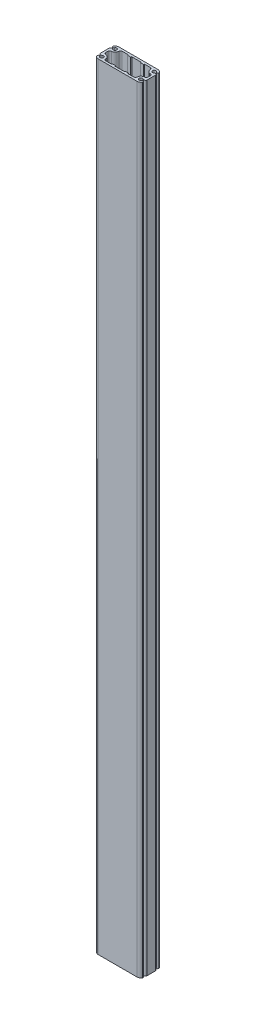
ISO-10303-21;
HEADER;
FILE_DESCRIPTION(('STEP AP214'),'2;1');
FILE_NAME('part.step','',(''),(''),'','','');
FILE_SCHEMA(('AUTOMOTIVE_DESIGN { 1 0 10303 214 1 1 1 1 }'));
ENDSEC;
DATA;
#1=APPLICATION_CONTEXT('core data for automotive mechanical design processes');
#2=APPLICATION_PROTOCOL_DEFINITION('international standard','automotive_design',2000,#1);
#3=PRODUCT_CONTEXT('',#1,'mechanical');
#4=PRODUCT('Part','Part','',(#3));
#5=PRODUCT_RELATED_PRODUCT_CATEGORY('part','',(#4));
#6=PRODUCT_DEFINITION_FORMATION('','',#4);
#7=PRODUCT_DEFINITION_CONTEXT('part definition',#1,'design');
#8=PRODUCT_DEFINITION('design','',#6,#7);
#9=PRODUCT_DEFINITION_SHAPE('','',#8);
#10=(LENGTH_UNIT() NAMED_UNIT(*) SI_UNIT(.MILLI.,.METRE.));
#11=(NAMED_UNIT(*) PLANE_ANGLE_UNIT() SI_UNIT($,.RADIAN.));
#12=(NAMED_UNIT(*) SI_UNIT($,.STERADIAN.) SOLID_ANGLE_UNIT());
#13=UNCERTAINTY_MEASURE_WITH_UNIT(LENGTH_MEASURE(1.E-05),#10,'distance_accuracy_value','');
#14=(GEOMETRIC_REPRESENTATION_CONTEXT(3) GLOBAL_UNCERTAINTY_ASSIGNED_CONTEXT((#13)) GLOBAL_UNIT_ASSIGNED_CONTEXT((#10,
#11,#12)) REPRESENTATION_CONTEXT('',''));
#15=CARTESIAN_POINT('',(0.,0.,0.));
#16=DIRECTION('',(0.,0.,1.));
#17=DIRECTION('',(1.,0.,0.));
#18=AXIS2_PLACEMENT_3D('',#15,#16,#17);
#19=CARTESIAN_POINT('',(84.6938611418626,3000.,-30.5717765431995));
#20=DIRECTION('',(0.,1.,0.));
#21=DIRECTION('',(0.,0.,1.));
#22=AXIS2_PLACEMENT_3D('',#19,#20,#21);
#23=PLANE('',#22);
#24=CARTESIAN_POINT('',(84.6938611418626,3000.,-30.5717765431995));
#25=DIRECTION('',(0.,1.,0.));
#26=DIRECTION('',(0.,0.,1.));
#27=AXIS2_PLACEMENT_3D('',#24,#25,#26);
#28=CIRCLE('',#27,3.99999999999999);
#29=CARTESIAN_POINT('',(81.1914378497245,3000.,-28.6396711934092));
#30=VERTEX_POINT('',#29);
#31=CARTESIAN_POINT('',(88.1962844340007,3000.,-32.5038818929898));
#32=VERTEX_POINT('',#31);
#33=EDGE_CURVE('E598',#30,#32,#28,.T.);
#34=ORIENTED_EDGE('',*,*,#33,.T.);
#35=CARTESIAN_POINT('',(75.5,3000.,-25.5));
#36=DIRECTION('',(0.,1.,0.));
#37=DIRECTION('',(0.,0.,1.));
#38=AXIS2_PLACEMENT_3D('',#35,#36,#37);
#39=CIRCLE('',#38,14.5);
#40=CARTESIAN_POINT('',(75.5,3000.,-40.));
#41=VERTEX_POINT('',#40);
#42=EDGE_CURVE('E601',#32,#41,#39,.T.);
#43=ORIENTED_EDGE('',*,*,#42,.T.);
#44=DIRECTION('',(-1.,0.,0.));
#45=VECTOR('',#44,1.);
#46=CARTESIAN_POINT('',(75.5,3000.,-40.));
#47=LINE('',#46,#45);
#48=CARTESIAN_POINT('',(-75.5,3000.,-40.));
#49=VERTEX_POINT('',#48);
#50=EDGE_CURVE('E604',#41,#49,#47,.T.);
#51=ORIENTED_EDGE('',*,*,#50,.T.);
#52=CARTESIAN_POINT('',(-75.5,3000.,-25.5));
#53=DIRECTION('',(0.,1.,0.));
#54=DIRECTION('',(0.,0.,-1.));
#55=AXIS2_PLACEMENT_3D('',#52,#53,#54);
#56=CIRCLE('',#55,14.5);
#57=CARTESIAN_POINT('',(-88.1962844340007,3000.,-32.5038818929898));
#58=VERTEX_POINT('',#57);
#59=EDGE_CURVE('E606',#49,#58,#56,.T.);
#60=ORIENTED_EDGE('',*,*,#59,.T.);
#61=CARTESIAN_POINT('',(-84.6938611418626,3000.,-30.5717765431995));
#62=DIRECTION('',(0.,1.,0.));
#63=DIRECTION('',(0.,0.,-1.));
#64=AXIS2_PLACEMENT_3D('',#61,#62,#63);
#65=CIRCLE('',#64,3.99999999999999);
#66=CARTESIAN_POINT('',(-81.1914378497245,3000.,-28.6396711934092));
#67=VERTEX_POINT('',#66);
#68=EDGE_CURVE('E608',#58,#67,#65,.T.);
#69=ORIENTED_EDGE('',*,*,#68,.T.);
#70=CARTESIAN_POINT('',(-75.5,3000.,-25.5));
#71=DIRECTION('',(0.,-1.,0.));
#72=DIRECTION('',(0.,0.,-1.));
#73=AXIS2_PLACEMENT_3D('',#70,#71,#72);
#74=CIRCLE('',#73,6.5);
#75=CARTESIAN_POINT('',(-79.7220192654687,3000.,-20.5578796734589));
#76=VERTEX_POINT('',#75);
#77=EDGE_CURVE('E610',#67,#76,#74,.T.);
#78=ORIENTED_EDGE('',*,*,#77,.T.);
#79=CARTESIAN_POINT('',(-83.7691890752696,3000.,-15.8204308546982));
#80=DIRECTION('',(0.,1.,0.));
#81=DIRECTION('',(0.,0.,-1.));
#82=AXIS2_PLACEMENT_3D('',#79,#80,#81);
#83=CIRCLE('',#82,6.23081092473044);
#84=CARTESIAN_POINT('',(-90.,3000.,-15.8204308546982));
#85=VERTEX_POINT('',#84);
#86=EDGE_CURVE('E612',#76,#85,#83,.T.);
#87=ORIENTED_EDGE('',*,*,#86,.T.);
#88=DIRECTION('',(0.,0.,1.));
#89=VECTOR('',#88,1.);
#90=CARTESIAN_POINT('',(-90.,3000.,15.8204308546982));
#91=LINE('',#90,#89);
#92=CARTESIAN_POINT('',(-90.,3000.,15.8204308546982));
#93=VERTEX_POINT('',#92);
#94=EDGE_CURVE('E614',#85,#93,#91,.T.);
#95=ORIENTED_EDGE('',*,*,#94,.T.);
#96=CARTESIAN_POINT('',(-83.7691890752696,3000.,15.8204308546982));
#97=DIRECTION('',(0.,1.,0.));
#98=DIRECTION('',(0.,0.,1.));
#99=AXIS2_PLACEMENT_3D('',#96,#97,#98);
#100=CIRCLE('',#99,6.23081092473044);
#101=CARTESIAN_POINT('',(-79.7220192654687,3000.,20.5578796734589));
#102=VERTEX_POINT('',#101);
#103=EDGE_CURVE('E616',#93,#102,#100,.T.);
#104=ORIENTED_EDGE('',*,*,#103,.T.);
#105=CARTESIAN_POINT('',(-75.5,3000.,25.5));
#106=DIRECTION('',(0.,-1.,0.));
#107=DIRECTION('',(0.,0.,1.));
#108=AXIS2_PLACEMENT_3D('',#105,#106,#107);
#109=CIRCLE('',#108,6.5);
#110=CARTESIAN_POINT('',(-81.1914378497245,3000.,28.6396711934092));
#111=VERTEX_POINT('',#110);
#112=EDGE_CURVE('E618',#102,#111,#109,.T.);
#113=ORIENTED_EDGE('',*,*,#112,.T.);
#114=CARTESIAN_POINT('',(-84.6938611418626,3000.,30.5717765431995));
#115=DIRECTION('',(0.,1.,0.));
#116=DIRECTION('',(0.,0.,1.));
#117=AXIS2_PLACEMENT_3D('',#114,#115,#116);
#118=CIRCLE('',#117,3.99999999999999);
#119=CARTESIAN_POINT('',(-88.1962844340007,3000.,32.5038818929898));
#120=VERTEX_POINT('',#119);
#121=EDGE_CURVE('E620',#111,#120,#118,.T.);
#122=ORIENTED_EDGE('',*,*,#121,.T.);
#123=CARTESIAN_POINT('',(-75.5,3000.,25.5));
#124=DIRECTION('',(0.,1.,0.));
#125=DIRECTION('',(0.,0.,1.));
#126=AXIS2_PLACEMENT_3D('',#123,#124,#125);
#127=CIRCLE('',#126,14.5);
#128=CARTESIAN_POINT('',(-75.5,3000.,40.));
#129=VERTEX_POINT('',#128);
#130=EDGE_CURVE('E622',#120,#129,#127,.T.);
#131=ORIENTED_EDGE('',*,*,#130,.T.);
#132=DIRECTION('',(1.,0.,0.));
#133=VECTOR('',#132,1.);
#134=CARTESIAN_POINT('',(75.5,3000.,40.));
#135=LINE('',#134,#133);
#136=CARTESIAN_POINT('',(75.5,3000.,40.));
#137=VERTEX_POINT('',#136);
#138=EDGE_CURVE('E624',#129,#137,#135,.T.);
#139=ORIENTED_EDGE('',*,*,#138,.T.);
#140=CARTESIAN_POINT('',(75.5,3000.,25.5));
#141=DIRECTION('',(0.,1.,0.));
#142=DIRECTION('',(0.,0.,-1.));
#143=AXIS2_PLACEMENT_3D('',#140,#141,#142);
#144=CIRCLE('',#143,14.5);
#145=CARTESIAN_POINT('',(88.1962844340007,3000.,32.5038818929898));
#146=VERTEX_POINT('',#145);
#147=EDGE_CURVE('E626',#137,#146,#144,.T.);
#148=ORIENTED_EDGE('',*,*,#147,.T.);
#149=CARTESIAN_POINT('',(84.6938611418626,3000.,30.5717765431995));
#150=DIRECTION('',(0.,1.,0.));
#151=DIRECTION('',(0.,0.,-1.));
#152=AXIS2_PLACEMENT_3D('',#149,#150,#151);
#153=CIRCLE('',#152,3.99999999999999);
#154=CARTESIAN_POINT('',(81.1914378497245,3000.,28.6396711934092));
#155=VERTEX_POINT('',#154);
#156=EDGE_CURVE('E628',#146,#155,#153,.T.);
#157=ORIENTED_EDGE('',*,*,#156,.T.);
#158=CARTESIAN_POINT('',(75.5,3000.,25.5));
#159=DIRECTION('',(0.,-1.,0.));
#160=DIRECTION('',(0.,0.,-1.));
#161=AXIS2_PLACEMENT_3D('',#158,#159,#160);
#162=CIRCLE('',#161,6.5);
#163=CARTESIAN_POINT('',(79.7220192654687,3000.,20.5578796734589));
#164=VERTEX_POINT('',#163);
#165=EDGE_CURVE('E630',#155,#164,#162,.T.);
#166=ORIENTED_EDGE('',*,*,#165,.T.);
#167=CARTESIAN_POINT('',(83.7691890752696,3000.,15.8204308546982));
#168=DIRECTION('',(0.,1.,0.));
#169=DIRECTION('',(0.,0.,-1.));
#170=AXIS2_PLACEMENT_3D('',#167,#168,#169);
#171=CIRCLE('',#170,6.23081092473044);
#172=CARTESIAN_POINT('',(90.,3000.,15.8204308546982));
#173=VERTEX_POINT('',#172);
#174=EDGE_CURVE('E632',#164,#173,#171,.T.);
#175=ORIENTED_EDGE('',*,*,#174,.T.);
#176=DIRECTION('',(0.,0.,-1.));
#177=VECTOR('',#176,1.);
#178=CARTESIAN_POINT('',(90.,3000.,15.8204308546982));
#179=LINE('',#178,#177);
#180=CARTESIAN_POINT('',(90.,3000.,-15.8204308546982));
#181=VERTEX_POINT('',#180);
#182=EDGE_CURVE('E634',#173,#181,#179,.T.);
#183=ORIENTED_EDGE('',*,*,#182,.T.);
#184=CARTESIAN_POINT('',(83.7691890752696,3000.,-15.8204308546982));
#185=DIRECTION('',(0.,1.,0.));
#186=DIRECTION('',(0.,0.,1.));
#187=AXIS2_PLACEMENT_3D('',#184,#185,#186);
#188=CIRCLE('',#187,6.23081092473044);
#189=CARTESIAN_POINT('',(79.7220192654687,3000.,-20.5578796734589));
#190=VERTEX_POINT('',#189);
#191=EDGE_CURVE('E636',#181,#190,#188,.T.);
#192=ORIENTED_EDGE('',*,*,#191,.T.);
#193=CARTESIAN_POINT('',(75.5,3000.,-25.5));
#194=DIRECTION('',(0.,-1.,0.));
#195=DIRECTION('',(0.,0.,1.));
#196=AXIS2_PLACEMENT_3D('',#193,#194,#195);
#197=CIRCLE('',#196,6.5);
#198=EDGE_CURVE('E638',#190,#30,#197,.T.);
#199=ORIENTED_EDGE('',*,*,#198,.T.);
#200=EDGE_LOOP('',(#34,#43,#51,#60,#69,#78,#87,#95,#104,#113,#122,#131,#139,#148,#157,#166,#175,
#183,#192,#199));
#201=FACE_BOUND('',#200,.T.);
#202=CARTESIAN_POINT('',(54.5,3000.,-25.5));
#203=DIRECTION('',(0.,1.,0.));
#204=DIRECTION('',(0.,0.,1.));
#205=AXIS2_PLACEMENT_3D('',#202,#203,#204);
#206=CIRCLE('',#205,6.5);
#207=CARTESIAN_POINT('',(61.,3000.,-25.5));
#208=VERTEX_POINT('',#207);
#209=CARTESIAN_POINT('',(54.5,3000.,-32.));
#210=VERTEX_POINT('',#209);
#211=EDGE_CURVE('E373',#208,#210,#206,.T.);
#212=ORIENTED_EDGE('',*,*,#211,.F.);
#213=CARTESIAN_POINT('',(75.5,3000.,-25.5));
#214=DIRECTION('',(0.,-1.,0.));
#215=DIRECTION('',(0.,0.,1.));
#216=AXIS2_PLACEMENT_3D('',#213,#214,#215);
#217=CIRCLE('',#216,14.5);
#218=CARTESIAN_POINT('',(75.5,3000.,-11.));
#219=VERTEX_POINT('',#218);
#220=EDGE_CURVE('E365',#219,#208,#217,.T.);
#221=ORIENTED_EDGE('',*,*,#220,.F.);
#222=CARTESIAN_POINT('',(75.5,3000.,-4.5));
#223=DIRECTION('',(0.,1.,0.));
#224=DIRECTION('',(0.,0.,1.));
#225=AXIS2_PLACEMENT_3D('',#222,#223,#224);
#226=CIRCLE('',#225,6.5);
#227=CARTESIAN_POINT('',(82.,3000.,-4.5));
#228=VERTEX_POINT('',#227);
#229=EDGE_CURVE('E446',#228,#219,#226,.T.);
#230=ORIENTED_EDGE('',*,*,#229,.F.);
#231=DIRECTION('',(0.,0.,-1.));
#232=VECTOR('',#231,1.);
#233=CARTESIAN_POINT('',(82.,3000.,-4.5));
#234=LINE('',#233,#232);
#235=CARTESIAN_POINT('',(82.,3000.,4.5));
#236=VERTEX_POINT('',#235);
#237=EDGE_CURVE('E444',#236,#228,#234,.T.);
#238=ORIENTED_EDGE('',*,*,#237,.F.);
#239=CARTESIAN_POINT('',(75.5,3000.,4.5));
#240=DIRECTION('',(0.,1.,0.));
#241=DIRECTION('',(0.,0.,-1.));
#242=AXIS2_PLACEMENT_3D('',#239,#240,#241);
#243=CIRCLE('',#242,6.5);
#244=CARTESIAN_POINT('',(75.5,3000.,11.));
#245=VERTEX_POINT('',#244);
#246=EDGE_CURVE('E442',#245,#236,#243,.T.);
#247=ORIENTED_EDGE('',*,*,#246,.F.);
#248=CARTESIAN_POINT('',(75.5,3000.,25.5));
#249=DIRECTION('',(0.,-1.,0.));
#250=DIRECTION('',(0.,0.,-1.));
#251=AXIS2_PLACEMENT_3D('',#248,#249,#250);
#252=CIRCLE('',#251,14.5);
#253=CARTESIAN_POINT('',(61.,3000.,25.5));
#254=VERTEX_POINT('',#253);
#255=EDGE_CURVE('E440',#254,#245,#252,.T.);
#256=ORIENTED_EDGE('',*,*,#255,.F.);
#257=CARTESIAN_POINT('',(54.5,3000.,25.5));
#258=DIRECTION('',(0.,1.,0.));
#259=DIRECTION('',(0.,0.,-1.));
#260=AXIS2_PLACEMENT_3D('',#257,#258,#259);
#261=CIRCLE('',#260,6.5);
#262=CARTESIAN_POINT('',(54.5,3000.,32.));
#263=VERTEX_POINT('',#262);
#264=EDGE_CURVE('E438',#263,#254,#261,.T.);
#265=ORIENTED_EDGE('',*,*,#264,.F.);
#266=DIRECTION('',(1.,0.,0.));
#267=VECTOR('',#266,1.);
#268=CARTESIAN_POINT('',(32.5172988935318,3000.,32.));
#269=LINE('',#268,#267);
#270=CARTESIAN_POINT('',(32.5172988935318,3000.,32.));
#271=VERTEX_POINT('',#270);
#272=EDGE_CURVE('E436',#271,#263,#269,.T.);
#273=ORIENTED_EDGE('',*,*,#272,.F.);
#274=DIRECTION('',(0.642787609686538,0.,0.766044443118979));
#275=VECTOR('',#274,1.);
#276=CARTESIAN_POINT('',(30.,3000.,29.));
#277=LINE('',#276,#275);
#278=CARTESIAN_POINT('',(30.,3000.,29.));
#279=VERTEX_POINT('',#278);
#280=EDGE_CURVE('E434',#279,#271,#277,.T.);
#281=ORIENTED_EDGE('',*,*,#280,.F.);
#282=DIRECTION('',(1.,0.,0.));
#283=VECTOR('',#282,1.);
#284=CARTESIAN_POINT('',(20.,3000.,29.));
#285=LINE('',#284,#283);
#286=CARTESIAN_POINT('',(20.,3000.,29.));
#287=VERTEX_POINT('',#286);
#288=EDGE_CURVE('E432',#287,#279,#285,.T.);
#289=ORIENTED_EDGE('',*,*,#288,.F.);
#290=DIRECTION('',(0.642787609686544,0.,-0.766044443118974));
#291=VECTOR('',#290,1.);
#292=CARTESIAN_POINT('',(20.,3000.,29.));
#293=LINE('',#292,#291);
#294=CARTESIAN_POINT('',(17.4827011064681,3000.,32.));
#295=VERTEX_POINT('',#294);
#296=EDGE_CURVE('E430',#295,#287,#293,.T.);
#297=ORIENTED_EDGE('',*,*,#296,.F.);
#298=DIRECTION('',(1.,0.,0.));
#299=VECTOR('',#298,1.);
#300=CARTESIAN_POINT('',(-17.4827011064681,3000.,32.));
#301=LINE('',#300,#299);
#302=CARTESIAN_POINT('',(-17.4827011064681,3000.,32.));
#303=VERTEX_POINT('',#302);
#304=EDGE_CURVE('E428',#303,#295,#301,.T.);
#305=ORIENTED_EDGE('',*,*,#304,.F.);
#306=DIRECTION('',(0.642787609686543,0.,0.766044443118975));
#307=VECTOR('',#306,1.);
#308=CARTESIAN_POINT('',(-20.,3000.,29.));
#309=LINE('',#308,#307);
#310=CARTESIAN_POINT('',(-20.,3000.,29.));
#311=VERTEX_POINT('',#310);
#312=EDGE_CURVE('E426',#311,#303,#309,.T.);
#313=ORIENTED_EDGE('',*,*,#312,.F.);
#314=DIRECTION('',(1.,0.,0.));
#315=VECTOR('',#314,1.);
#316=CARTESIAN_POINT('',(-20.,3000.,29.));
#317=LINE('',#316,#315);
#318=CARTESIAN_POINT('',(-30.,3000.,29.));
#319=VERTEX_POINT('',#318);
#320=EDGE_CURVE('E424',#319,#311,#317,.T.);
#321=ORIENTED_EDGE('',*,*,#320,.F.);
#322=DIRECTION('',(0.642787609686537,0.,-0.76604444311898));
#323=VECTOR('',#322,1.);
#324=CARTESIAN_POINT('',(-30.,3000.,29.));
#325=LINE('',#324,#323);
#326=CARTESIAN_POINT('',(-32.5172988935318,3000.,32.));
#327=VERTEX_POINT('',#326);
#328=EDGE_CURVE('E422',#327,#319,#325,.T.);
#329=ORIENTED_EDGE('',*,*,#328,.F.);
#330=DIRECTION('',(1.,0.,0.));
#331=VECTOR('',#330,1.);
#332=CARTESIAN_POINT('',(-32.5172988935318,3000.,32.));
#333=LINE('',#332,#331);
#334=CARTESIAN_POINT('',(-54.5,3000.,32.));
#335=VERTEX_POINT('',#334);
#336=EDGE_CURVE('E420',#335,#327,#333,.T.);
#337=ORIENTED_EDGE('',*,*,#336,.F.);
#338=CARTESIAN_POINT('',(-54.5,3000.,25.5));
#339=DIRECTION('',(0.,1.,0.));
#340=DIRECTION('',(0.,0.,1.));
#341=AXIS2_PLACEMENT_3D('',#338,#339,#340);
#342=CIRCLE('',#341,6.5);
#343=CARTESIAN_POINT('',(-61.,3000.,25.5));
#344=VERTEX_POINT('',#343);
#345=EDGE_CURVE('E418',#344,#335,#342,.T.);
#346=ORIENTED_EDGE('',*,*,#345,.F.);
#347=CARTESIAN_POINT('',(-75.5,3000.,25.5));
#348=DIRECTION('',(0.,-1.,0.));
#349=DIRECTION('',(0.,0.,1.));
#350=AXIS2_PLACEMENT_3D('',#347,#348,#349);
#351=CIRCLE('',#350,14.5);
#352=CARTESIAN_POINT('',(-75.5,3000.,11.));
#353=VERTEX_POINT('',#352);
#354=EDGE_CURVE('E416',#353,#344,#351,.T.);
#355=ORIENTED_EDGE('',*,*,#354,.F.);
#356=CARTESIAN_POINT('',(-75.5,3000.,4.5));
#357=DIRECTION('',(0.,1.,0.));
#358=DIRECTION('',(0.,0.,1.));
#359=AXIS2_PLACEMENT_3D('',#356,#357,#358);
#360=CIRCLE('',#359,6.5);
#361=CARTESIAN_POINT('',(-82.,3000.,4.5));
#362=VERTEX_POINT('',#361);
#363=EDGE_CURVE('E414',#362,#353,#360,.T.);
#364=ORIENTED_EDGE('',*,*,#363,.F.);
#365=DIRECTION('',(0.,0.,1.));
#366=VECTOR('',#365,1.);
#367=CARTESIAN_POINT('',(-82.,3000.,-4.5));
#368=LINE('',#367,#366);
#369=CARTESIAN_POINT('',(-82.,3000.,-4.5));
#370=VERTEX_POINT('',#369);
#371=EDGE_CURVE('E412',#370,#362,#368,.T.);
#372=ORIENTED_EDGE('',*,*,#371,.F.);
#373=CARTESIAN_POINT('',(-75.5,3000.,-4.5));
#374=DIRECTION('',(0.,1.,0.));
#375=DIRECTION('',(0.,0.,-1.));
#376=AXIS2_PLACEMENT_3D('',#373,#374,#375);
#377=CIRCLE('',#376,6.5);
#378=CARTESIAN_POINT('',(-75.5,3000.,-11.));
#379=VERTEX_POINT('',#378);
#380=EDGE_CURVE('E410',#379,#370,#377,.T.);
#381=ORIENTED_EDGE('',*,*,#380,.F.);
#382=CARTESIAN_POINT('',(-75.5,3000.,-25.5));
#383=DIRECTION('',(0.,-1.,0.));
#384=DIRECTION('',(0.,0.,-1.));
#385=AXIS2_PLACEMENT_3D('',#382,#383,#384);
#386=CIRCLE('',#385,14.5);
#387=CARTESIAN_POINT('',(-61.,3000.,-25.5));
#388=VERTEX_POINT('',#387);
#389=EDGE_CURVE('E408',#388,#379,#386,.T.);
#390=ORIENTED_EDGE('',*,*,#389,.F.);
#391=CARTESIAN_POINT('',(-54.5,3000.,-25.5));
#392=DIRECTION('',(0.,1.,0.));
#393=DIRECTION('',(0.,0.,-1.));
#394=AXIS2_PLACEMENT_3D('',#391,#392,#393);
#395=CIRCLE('',#394,6.5);
#396=CARTESIAN_POINT('',(-54.5,3000.,-32.));
#397=VERTEX_POINT('',#396);
#398=EDGE_CURVE('E406',#397,#388,#395,.T.);
#399=ORIENTED_EDGE('',*,*,#398,.F.);
#400=DIRECTION('',(-1.,0.,0.));
#401=VECTOR('',#400,1.);
#402=CARTESIAN_POINT('',(-32.5172988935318,3000.,-32.));
#403=LINE('',#402,#401);
#404=CARTESIAN_POINT('',(-32.5172988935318,3000.,-32.));
#405=VERTEX_POINT('',#404);
#406=EDGE_CURVE('E404',#405,#397,#403,.T.);
#407=ORIENTED_EDGE('',*,*,#406,.F.);
#408=DIRECTION('',(-0.642787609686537,0.,-0.76604444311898));
#409=VECTOR('',#408,1.);
#410=CARTESIAN_POINT('',(-30.,3000.,-29.));
#411=LINE('',#410,#409);
#412=CARTESIAN_POINT('',(-30.,3000.,-29.));
#413=VERTEX_POINT('',#412);
#414=EDGE_CURVE('E402',#413,#405,#411,.T.);
#415=ORIENTED_EDGE('',*,*,#414,.F.);
#416=DIRECTION('',(-1.,0.,0.));
#417=VECTOR('',#416,1.);
#418=CARTESIAN_POINT('',(-20.,3000.,-29.));
#419=LINE('',#418,#417);
#420=CARTESIAN_POINT('',(-20.,3000.,-29.));
#421=VERTEX_POINT('',#420);
#422=EDGE_CURVE('E400',#421,#413,#419,.T.);
#423=ORIENTED_EDGE('',*,*,#422,.F.);
#424=DIRECTION('',(-0.642787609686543,0.,0.766044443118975));
#425=VECTOR('',#424,1.);
#426=CARTESIAN_POINT('',(-20.,3000.,-29.));
#427=LINE('',#426,#425);
#428=CARTESIAN_POINT('',(-17.4827011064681,3000.,-32.));
#429=VERTEX_POINT('',#428);
#430=EDGE_CURVE('E398',#429,#421,#427,.T.);
#431=ORIENTED_EDGE('',*,*,#430,.F.);
#432=DIRECTION('',(-1.,0.,0.));
#433=VECTOR('',#432,1.);
#434=CARTESIAN_POINT('',(-17.4827011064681,3000.,-32.));
#435=LINE('',#434,#433);
#436=CARTESIAN_POINT('',(17.4827011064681,3000.,-32.));
#437=VERTEX_POINT('',#436);
#438=EDGE_CURVE('E396',#437,#429,#435,.T.);
#439=ORIENTED_EDGE('',*,*,#438,.F.);
#440=DIRECTION('',(-0.642787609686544,0.,-0.766044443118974));
#441=VECTOR('',#440,1.);
#442=CARTESIAN_POINT('',(20.,3000.,-29.));
#443=LINE('',#442,#441);
#444=CARTESIAN_POINT('',(20.,3000.,-29.));
#445=VERTEX_POINT('',#444);
#446=EDGE_CURVE('E394',#445,#437,#443,.T.);
#447=ORIENTED_EDGE('',*,*,#446,.F.);
#448=DIRECTION('',(-1.,0.,0.));
#449=VECTOR('',#448,1.);
#450=CARTESIAN_POINT('',(20.,3000.,-29.));
#451=LINE('',#450,#449);
#452=CARTESIAN_POINT('',(30.,3000.,-29.));
#453=VERTEX_POINT('',#452);
#454=EDGE_CURVE('E392',#453,#445,#451,.T.);
#455=ORIENTED_EDGE('',*,*,#454,.F.);
#456=DIRECTION('',(-0.642787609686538,0.,0.766044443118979));
#457=VECTOR('',#456,1.);
#458=CARTESIAN_POINT('',(30.,3000.,-29.));
#459=LINE('',#458,#457);
#460=CARTESIAN_POINT('',(32.5172988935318,3000.,-32.));
#461=VERTEX_POINT('',#460);
#462=EDGE_CURVE('E388',#461,#453,#459,.T.);
#463=ORIENTED_EDGE('',*,*,#462,.F.);
#464=DIRECTION('',(-1.,0.,0.));
#465=VECTOR('',#464,1.);
#466=CARTESIAN_POINT('',(32.5172988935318,3000.,-32.));
#467=LINE('',#466,#465);
#468=EDGE_CURVE('E386',#210,#461,#467,.T.);
#469=ORIENTED_EDGE('',*,*,#468,.F.);
#470=EDGE_LOOP('',(#212,#221,#230,#238,#247,#256,#265,#273,#281,#289,#297,#305,#313,#321,#329,
#337,#346,#355,#364,#372,#381,#390,#399,#407,#415,#423,#431,#439,#447,#455,#463,#469));
#471=FACE_BOUND('',#470,.T.);
#472=ADVANCED_FACE('F36',(#201,#471),#23,.T.);
#473=CARTESIAN_POINT('',(84.6938611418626,0.,-30.5717765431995));
#474=DIRECTION('',(0.,1.,0.));
#475=DIRECTION('',(0.,0.,1.));
#476=AXIS2_PLACEMENT_3D('',#473,#474,#475);
#477=PLANE('',#476);
#478=CARTESIAN_POINT('',(84.6938611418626,0.,-30.5717765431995));
#479=DIRECTION('',(0.,1.,0.));
#480=DIRECTION('',(0.,0.,1.));
#481=AXIS2_PLACEMENT_3D('',#478,#479,#480);
#482=CIRCLE('',#481,3.99999999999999);
#483=CARTESIAN_POINT('',(81.1914378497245,0.,-28.6396711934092));
#484=VERTEX_POINT('',#483);
#485=CARTESIAN_POINT('',(88.1962844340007,0.,-32.5038818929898));
#486=VERTEX_POINT('',#485);
#487=EDGE_CURVE('E381',#484,#486,#482,.T.);
#488=ORIENTED_EDGE('',*,*,#487,.F.);
#489=CARTESIAN_POINT('',(75.5,0.,-25.5));
#490=DIRECTION('',(0.,-1.,0.));
#491=DIRECTION('',(0.,0.,1.));
#492=AXIS2_PLACEMENT_3D('',#489,#490,#491);
#493=CIRCLE('',#492,6.5);
#494=CARTESIAN_POINT('',(79.7220192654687,0.,-20.5578796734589));
#495=VERTEX_POINT('',#494);
#496=EDGE_CURVE('E602',#495,#484,#493,.T.);
#497=ORIENTED_EDGE('',*,*,#496,.F.);
#498=CARTESIAN_POINT('',(83.7691890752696,0.,-15.8204308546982));
#499=DIRECTION('',(0.,1.,0.));
#500=DIRECTION('',(0.,0.,1.));
#501=AXIS2_PLACEMENT_3D('',#498,#499,#500);
#502=CIRCLE('',#501,6.23081092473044);
#503=CARTESIAN_POINT('',(90.,0.,-15.8204308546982));
#504=VERTEX_POINT('',#503);
#505=EDGE_CURVE('E677',#504,#495,#502,.T.);
#506=ORIENTED_EDGE('',*,*,#505,.F.);
#507=DIRECTION('',(0.,0.,-1.));
#508=VECTOR('',#507,1.);
#509=CARTESIAN_POINT('',(90.,0.,15.8204308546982));
#510=LINE('',#509,#508);
#511=CARTESIAN_POINT('',(90.,0.,15.8204308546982));
#512=VERTEX_POINT('',#511);
#513=EDGE_CURVE('E675',#512,#504,#510,.T.);
#514=ORIENTED_EDGE('',*,*,#513,.F.);
#515=CARTESIAN_POINT('',(83.7691890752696,0.,15.8204308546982));
#516=DIRECTION('',(0.,1.,0.));
#517=DIRECTION('',(0.,0.,-1.));
#518=AXIS2_PLACEMENT_3D('',#515,#516,#517);
#519=CIRCLE('',#518,6.23081092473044);
#520=CARTESIAN_POINT('',(79.7220192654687,0.,20.5578796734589));
#521=VERTEX_POINT('',#520);
#522=EDGE_CURVE('E673',#521,#512,#519,.T.);
#523=ORIENTED_EDGE('',*,*,#522,.F.);
#524=CARTESIAN_POINT('',(75.5,0.,25.5));
#525=DIRECTION('',(0.,-1.,0.));
#526=DIRECTION('',(0.,0.,-1.));
#527=AXIS2_PLACEMENT_3D('',#524,#525,#526);
#528=CIRCLE('',#527,6.5);
#529=CARTESIAN_POINT('',(81.1914378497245,0.,28.6396711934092));
#530=VERTEX_POINT('',#529);
#531=EDGE_CURVE('E671',#530,#521,#528,.T.);
#532=ORIENTED_EDGE('',*,*,#531,.F.);
#533=CARTESIAN_POINT('',(84.6938611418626,0.,30.5717765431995));
#534=DIRECTION('',(0.,1.,0.));
#535=DIRECTION('',(0.,0.,-1.));
#536=AXIS2_PLACEMENT_3D('',#533,#534,#535);
#537=CIRCLE('',#536,3.99999999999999);
#538=CARTESIAN_POINT('',(88.1962844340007,0.,32.5038818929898));
#539=VERTEX_POINT('',#538);
#540=EDGE_CURVE('E669',#539,#530,#537,.T.);
#541=ORIENTED_EDGE('',*,*,#540,.F.);
#542=CARTESIAN_POINT('',(75.5,0.,25.5));
#543=DIRECTION('',(0.,1.,0.));
#544=DIRECTION('',(0.,0.,-1.));
#545=AXIS2_PLACEMENT_3D('',#542,#543,#544);
#546=CIRCLE('',#545,14.5);
#547=CARTESIAN_POINT('',(75.5,0.,40.));
#548=VERTEX_POINT('',#547);
#549=EDGE_CURVE('E667',#548,#539,#546,.T.);
#550=ORIENTED_EDGE('',*,*,#549,.F.);
#551=DIRECTION('',(1.,0.,0.));
#552=VECTOR('',#551,1.);
#553=CARTESIAN_POINT('',(75.5,0.,40.));
#554=LINE('',#553,#552);
#555=CARTESIAN_POINT('',(-75.5,0.,40.));
#556=VERTEX_POINT('',#555);
#557=EDGE_CURVE('E665',#556,#548,#554,.T.);
#558=ORIENTED_EDGE('',*,*,#557,.F.);
#559=CARTESIAN_POINT('',(-75.5,0.,25.5));
#560=DIRECTION('',(0.,1.,0.));
#561=DIRECTION('',(0.,0.,1.));
#562=AXIS2_PLACEMENT_3D('',#559,#560,#561);
#563=CIRCLE('',#562,14.5);
#564=CARTESIAN_POINT('',(-88.1962844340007,0.,32.5038818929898));
#565=VERTEX_POINT('',#564);
#566=EDGE_CURVE('E663',#565,#556,#563,.T.);
#567=ORIENTED_EDGE('',*,*,#566,.F.);
#568=CARTESIAN_POINT('',(-84.6938611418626,0.,30.5717765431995));
#569=DIRECTION('',(0.,1.,0.));
#570=DIRECTION('',(0.,0.,1.));
#571=AXIS2_PLACEMENT_3D('',#568,#569,#570);
#572=CIRCLE('',#571,3.99999999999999);
#573=CARTESIAN_POINT('',(-81.1914378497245,0.,28.6396711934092));
#574=VERTEX_POINT('',#573);
#575=EDGE_CURVE('E661',#574,#565,#572,.T.);
#576=ORIENTED_EDGE('',*,*,#575,.F.);
#577=CARTESIAN_POINT('',(-75.5,0.,25.5));
#578=DIRECTION('',(0.,-1.,0.));
#579=DIRECTION('',(0.,0.,1.));
#580=AXIS2_PLACEMENT_3D('',#577,#578,#579);
#581=CIRCLE('',#580,6.5);
#582=CARTESIAN_POINT('',(-79.7220192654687,0.,20.5578796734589));
#583=VERTEX_POINT('',#582);
#584=EDGE_CURVE('E659',#583,#574,#581,.T.);
#585=ORIENTED_EDGE('',*,*,#584,.F.);
#586=CARTESIAN_POINT('',(-83.7691890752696,0.,15.8204308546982));
#587=DIRECTION('',(0.,1.,0.));
#588=DIRECTION('',(0.,0.,1.));
#589=AXIS2_PLACEMENT_3D('',#586,#587,#588);
#590=CIRCLE('',#589,6.23081092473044);
#591=CARTESIAN_POINT('',(-90.,0.,15.8204308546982));
#592=VERTEX_POINT('',#591);
#593=EDGE_CURVE('E657',#592,#583,#590,.T.);
#594=ORIENTED_EDGE('',*,*,#593,.F.);
#595=DIRECTION('',(0.,0.,1.));
#596=VECTOR('',#595,1.);
#597=CARTESIAN_POINT('',(-90.,0.,15.8204308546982));
#598=LINE('',#597,#596);
#599=CARTESIAN_POINT('',(-90.,0.,-15.8204308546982));
#600=VERTEX_POINT('',#599);
#601=EDGE_CURVE('E655',#600,#592,#598,.T.);
#602=ORIENTED_EDGE('',*,*,#601,.F.);
#603=CARTESIAN_POINT('',(-83.7691890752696,0.,-15.8204308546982));
#604=DIRECTION('',(0.,1.,0.));
#605=DIRECTION('',(0.,0.,-1.));
#606=AXIS2_PLACEMENT_3D('',#603,#604,#605);
#607=CIRCLE('',#606,6.23081092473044);
#608=CARTESIAN_POINT('',(-79.7220192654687,0.,-20.5578796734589));
#609=VERTEX_POINT('',#608);
#610=EDGE_CURVE('E653',#609,#600,#607,.T.);
#611=ORIENTED_EDGE('',*,*,#610,.F.);
#612=CARTESIAN_POINT('',(-75.5,0.,-25.5));
#613=DIRECTION('',(0.,-1.,0.));
#614=DIRECTION('',(0.,0.,-1.));
#615=AXIS2_PLACEMENT_3D('',#612,#613,#614);
#616=CIRCLE('',#615,6.5);
#617=CARTESIAN_POINT('',(-81.1914378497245,0.,-28.6396711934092));
#618=VERTEX_POINT('',#617);
#619=EDGE_CURVE('E651',#618,#609,#616,.T.);
#620=ORIENTED_EDGE('',*,*,#619,.F.);
#621=CARTESIAN_POINT('',(-84.6938611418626,0.,-30.5717765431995));
#622=DIRECTION('',(0.,1.,0.));
#623=DIRECTION('',(0.,0.,-1.));
#624=AXIS2_PLACEMENT_3D('',#621,#622,#623);
#625=CIRCLE('',#624,3.99999999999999);
#626=CARTESIAN_POINT('',(-88.1962844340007,0.,-32.5038818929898));
#627=VERTEX_POINT('',#626);
#628=EDGE_CURVE('E649',#627,#618,#625,.T.);
#629=ORIENTED_EDGE('',*,*,#628,.F.);
#630=CARTESIAN_POINT('',(-75.5,0.,-25.5));
#631=DIRECTION('',(0.,1.,0.));
#632=DIRECTION('',(0.,0.,-1.));
#633=AXIS2_PLACEMENT_3D('',#630,#631,#632);
#634=CIRCLE('',#633,14.5);
#635=CARTESIAN_POINT('',(-75.5,0.,-40.));
#636=VERTEX_POINT('',#635);
#637=EDGE_CURVE('E647',#636,#627,#634,.T.);
#638=ORIENTED_EDGE('',*,*,#637,.F.);
#639=DIRECTION('',(-1.,0.,0.));
#640=VECTOR('',#639,1.);
#641=CARTESIAN_POINT('',(75.5,0.,-40.));
#642=LINE('',#641,#640);
#643=CARTESIAN_POINT('',(75.5,0.,-40.));
#644=VERTEX_POINT('',#643);
#645=EDGE_CURVE('E645',#644,#636,#642,.T.);
#646=ORIENTED_EDGE('',*,*,#645,.F.);
#647=CARTESIAN_POINT('',(75.5,0.,-25.5));
#648=DIRECTION('',(0.,1.,0.));
#649=DIRECTION('',(0.,0.,1.));
#650=AXIS2_PLACEMENT_3D('',#647,#648,#649);
#651=CIRCLE('',#650,14.5);
#652=EDGE_CURVE('E643',#486,#644,#651,.T.);
#653=ORIENTED_EDGE('',*,*,#652,.F.);
#654=EDGE_LOOP('',(#488,#497,#506,#514,#523,#532,#541,#550,#558,#567,#576,#585,#594,#602,#611,
#620,#629,#638,#646,#653));
#655=FACE_BOUND('',#654,.T.);
#656=CARTESIAN_POINT('',(75.5,0.,-25.5));
#657=DIRECTION('',(0.,-1.,0.));
#658=DIRECTION('',(0.,0.,1.));
#659=AXIS2_PLACEMENT_3D('',#656,#657,#658);
#660=CIRCLE('',#659,14.5);
#661=CARTESIAN_POINT('',(75.5,0.,-11.));
#662=VERTEX_POINT('',#661);
#663=CARTESIAN_POINT('',(61.,0.,-25.5));
#664=VERTEX_POINT('',#663);
#665=EDGE_CURVE('E59',#662,#664,#660,.T.);
#666=ORIENTED_EDGE('',*,*,#665,.T.);
#667=CARTESIAN_POINT('',(54.5,0.,-25.5));
#668=DIRECTION('',(0.,1.,0.));
#669=DIRECTION('',(0.,0.,1.));
#670=AXIS2_PLACEMENT_3D('',#667,#668,#669);
#671=CIRCLE('',#670,6.5);
#672=CARTESIAN_POINT('',(54.5,0.,-32.));
#673=VERTEX_POINT('',#672);
#674=EDGE_CURVE('E380',#664,#673,#671,.T.);
#675=ORIENTED_EDGE('',*,*,#674,.T.);
#676=DIRECTION('',(-1.,0.,0.));
#677=VECTOR('',#676,1.);
#678=CARTESIAN_POINT('',(32.5172988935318,0.,-32.));
#679=LINE('',#678,#677);
#680=CARTESIAN_POINT('',(32.5172988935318,0.,-32.));
#681=VERTEX_POINT('',#680);
#682=EDGE_CURVE('E450',#673,#681,#679,.T.);
#683=ORIENTED_EDGE('',*,*,#682,.T.);
#684=DIRECTION('',(-0.642787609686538,0.,0.766044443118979));
#685=VECTOR('',#684,1.);
#686=CARTESIAN_POINT('',(30.,0.,-29.));
#687=LINE('',#686,#685);
#688=CARTESIAN_POINT('',(30.,0.,-29.));
#689=VERTEX_POINT('',#688);
#690=EDGE_CURVE('E453',#681,#689,#687,.T.);
#691=ORIENTED_EDGE('',*,*,#690,.T.);
#692=DIRECTION('',(-1.,0.,0.));
#693=VECTOR('',#692,1.);
#694=CARTESIAN_POINT('',(20.,0.,-29.));
#695=LINE('',#694,#693);
#696=CARTESIAN_POINT('',(20.,0.,-29.));
#697=VERTEX_POINT('',#696);
#698=EDGE_CURVE('E456',#689,#697,#695,.T.);
#699=ORIENTED_EDGE('',*,*,#698,.T.);
#700=DIRECTION('',(-0.642787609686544,0.,-0.766044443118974));
#701=VECTOR('',#700,1.);
#702=CARTESIAN_POINT('',(20.,0.,-29.));
#703=LINE('',#702,#701);
#704=CARTESIAN_POINT('',(17.4827011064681,0.,-32.));
#705=VERTEX_POINT('',#704);
#706=EDGE_CURVE('E459',#697,#705,#703,.T.);
#707=ORIENTED_EDGE('',*,*,#706,.T.);
#708=DIRECTION('',(-1.,0.,0.));
#709=VECTOR('',#708,1.);
#710=CARTESIAN_POINT('',(-17.4827011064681,0.,-32.));
#711=LINE('',#710,#709);
#712=CARTESIAN_POINT('',(-17.4827011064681,0.,-32.));
#713=VERTEX_POINT('',#712);
#714=EDGE_CURVE('E462',#705,#713,#711,.T.);
#715=ORIENTED_EDGE('',*,*,#714,.T.);
#716=DIRECTION('',(-0.642787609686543,0.,0.766044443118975));
#717=VECTOR('',#716,1.);
#718=CARTESIAN_POINT('',(-20.,0.,-29.));
#719=LINE('',#718,#717);
#720=CARTESIAN_POINT('',(-20.,0.,-29.));
#721=VERTEX_POINT('',#720);
#722=EDGE_CURVE('E465',#713,#721,#719,.T.);
#723=ORIENTED_EDGE('',*,*,#722,.T.);
#724=DIRECTION('',(-1.,0.,0.));
#725=VECTOR('',#724,1.);
#726=CARTESIAN_POINT('',(-20.,0.,-29.));
#727=LINE('',#726,#725);
#728=CARTESIAN_POINT('',(-30.,0.,-29.));
#729=VERTEX_POINT('',#728);
#730=EDGE_CURVE('E468',#721,#729,#727,.T.);
#731=ORIENTED_EDGE('',*,*,#730,.T.);
#732=DIRECTION('',(-0.642787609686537,0.,-0.76604444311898));
#733=VECTOR('',#732,1.);
#734=CARTESIAN_POINT('',(-30.,0.,-29.));
#735=LINE('',#734,#733);
#736=CARTESIAN_POINT('',(-32.5172988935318,0.,-32.));
#737=VERTEX_POINT('',#736);
#738=EDGE_CURVE('E471',#729,#737,#735,.T.);
#739=ORIENTED_EDGE('',*,*,#738,.T.);
#740=DIRECTION('',(-1.,0.,0.));
#741=VECTOR('',#740,1.);
#742=CARTESIAN_POINT('',(-32.5172988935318,0.,-32.));
#743=LINE('',#742,#741);
#744=CARTESIAN_POINT('',(-54.5,0.,-32.));
#745=VERTEX_POINT('',#744);
#746=EDGE_CURVE('E474',#737,#745,#743,.T.);
#747=ORIENTED_EDGE('',*,*,#746,.T.);
#748=CARTESIAN_POINT('',(-54.5,0.,-25.5));
#749=DIRECTION('',(0.,1.,0.));
#750=DIRECTION('',(0.,0.,-1.));
#751=AXIS2_PLACEMENT_3D('',#748,#749,#750);
#752=CIRCLE('',#751,6.5);
#753=CARTESIAN_POINT('',(-61.,0.,-25.5));
#754=VERTEX_POINT('',#753);
#755=EDGE_CURVE('E477',#745,#754,#752,.T.);
#756=ORIENTED_EDGE('',*,*,#755,.T.);
#757=CARTESIAN_POINT('',(-75.5,0.,-25.5));
#758=DIRECTION('',(0.,-1.,0.));
#759=DIRECTION('',(0.,0.,-1.));
#760=AXIS2_PLACEMENT_3D('',#757,#758,#759);
#761=CIRCLE('',#760,14.5);
#762=CARTESIAN_POINT('',(-75.5,0.,-11.));
#763=VERTEX_POINT('',#762);
#764=EDGE_CURVE('E480',#754,#763,#761,.T.);
#765=ORIENTED_EDGE('',*,*,#764,.T.);
#766=CARTESIAN_POINT('',(-75.5,0.,-4.5));
#767=DIRECTION('',(0.,1.,0.));
#768=DIRECTION('',(0.,0.,-1.));
#769=AXIS2_PLACEMENT_3D('',#766,#767,#768);
#770=CIRCLE('',#769,6.5);
#771=CARTESIAN_POINT('',(-82.,0.,-4.5));
#772=VERTEX_POINT('',#771);
#773=EDGE_CURVE('E483',#763,#772,#770,.T.);
#774=ORIENTED_EDGE('',*,*,#773,.T.);
#775=DIRECTION('',(0.,0.,1.));
#776=VECTOR('',#775,1.);
#777=CARTESIAN_POINT('',(-82.,0.,-4.5));
#778=LINE('',#777,#776);
#779=CARTESIAN_POINT('',(-82.,0.,4.5));
#780=VERTEX_POINT('',#779);
#781=EDGE_CURVE('E486',#772,#780,#778,.T.);
#782=ORIENTED_EDGE('',*,*,#781,.T.);
#783=CARTESIAN_POINT('',(-75.5,0.,4.5));
#784=DIRECTION('',(0.,1.,0.));
#785=DIRECTION('',(0.,0.,1.));
#786=AXIS2_PLACEMENT_3D('',#783,#784,#785);
#787=CIRCLE('',#786,6.5);
#788=CARTESIAN_POINT('',(-75.5,0.,11.));
#789=VERTEX_POINT('',#788);
#790=EDGE_CURVE('E489',#780,#789,#787,.T.);
#791=ORIENTED_EDGE('',*,*,#790,.T.);
#792=CARTESIAN_POINT('',(-75.5,0.,25.5));
#793=DIRECTION('',(0.,-1.,0.));
#794=DIRECTION('',(0.,0.,1.));
#795=AXIS2_PLACEMENT_3D('',#792,#793,#794);
#796=CIRCLE('',#795,14.5);
#797=CARTESIAN_POINT('',(-61.,0.,25.5));
#798=VERTEX_POINT('',#797);
#799=EDGE_CURVE('E492',#789,#798,#796,.T.);
#800=ORIENTED_EDGE('',*,*,#799,.T.);
#801=CARTESIAN_POINT('',(-54.5,0.,25.5));
#802=DIRECTION('',(0.,1.,0.));
#803=DIRECTION('',(0.,0.,1.));
#804=AXIS2_PLACEMENT_3D('',#801,#802,#803);
#805=CIRCLE('',#804,6.5);
#806=CARTESIAN_POINT('',(-54.5,0.,32.));
#807=VERTEX_POINT('',#806);
#808=EDGE_CURVE('E495',#798,#807,#805,.T.);
#809=ORIENTED_EDGE('',*,*,#808,.T.);
#810=DIRECTION('',(1.,0.,0.));
#811=VECTOR('',#810,1.);
#812=CARTESIAN_POINT('',(-32.5172988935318,0.,32.));
#813=LINE('',#812,#811);
#814=CARTESIAN_POINT('',(-32.5172988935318,0.,32.));
#815=VERTEX_POINT('',#814);
#816=EDGE_CURVE('E498',#807,#815,#813,.T.);
#817=ORIENTED_EDGE('',*,*,#816,.T.);
#818=DIRECTION('',(0.642787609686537,0.,-0.76604444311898));
#819=VECTOR('',#818,1.);
#820=CARTESIAN_POINT('',(-30.,0.,29.));
#821=LINE('',#820,#819);
#822=CARTESIAN_POINT('',(-30.,0.,29.));
#823=VERTEX_POINT('',#822);
#824=EDGE_CURVE('E501',#815,#823,#821,.T.);
#825=ORIENTED_EDGE('',*,*,#824,.T.);
#826=DIRECTION('',(1.,0.,0.));
#827=VECTOR('',#826,1.);
#828=CARTESIAN_POINT('',(-20.,0.,29.));
#829=LINE('',#828,#827);
#830=CARTESIAN_POINT('',(-20.,0.,29.));
#831=VERTEX_POINT('',#830);
#832=EDGE_CURVE('E504',#823,#831,#829,.T.);
#833=ORIENTED_EDGE('',*,*,#832,.T.);
#834=DIRECTION('',(0.642787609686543,0.,0.766044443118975));
#835=VECTOR('',#834,1.);
#836=CARTESIAN_POINT('',(-20.,0.,29.));
#837=LINE('',#836,#835);
#838=CARTESIAN_POINT('',(-17.4827011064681,0.,32.));
#839=VERTEX_POINT('',#838);
#840=EDGE_CURVE('E507',#831,#839,#837,.T.);
#841=ORIENTED_EDGE('',*,*,#840,.T.);
#842=DIRECTION('',(1.,0.,0.));
#843=VECTOR('',#842,1.);
#844=CARTESIAN_POINT('',(-17.4827011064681,0.,32.));
#845=LINE('',#844,#843);
#846=CARTESIAN_POINT('',(17.4827011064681,0.,32.));
#847=VERTEX_POINT('',#846);
#848=EDGE_CURVE('E510',#839,#847,#845,.T.);
#849=ORIENTED_EDGE('',*,*,#848,.T.);
#850=DIRECTION('',(0.642787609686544,0.,-0.766044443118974));
#851=VECTOR('',#850,1.);
#852=CARTESIAN_POINT('',(20.,0.,29.));
#853=LINE('',#852,#851);
#854=CARTESIAN_POINT('',(20.,0.,29.));
#855=VERTEX_POINT('',#854);
#856=EDGE_CURVE('E513',#847,#855,#853,.T.);
#857=ORIENTED_EDGE('',*,*,#856,.T.);
#858=DIRECTION('',(1.,0.,0.));
#859=VECTOR('',#858,1.);
#860=CARTESIAN_POINT('',(20.,0.,29.));
#861=LINE('',#860,#859);
#862=CARTESIAN_POINT('',(30.,0.,29.));
#863=VERTEX_POINT('',#862);
#864=EDGE_CURVE('E516',#855,#863,#861,.T.);
#865=ORIENTED_EDGE('',*,*,#864,.T.);
#866=DIRECTION('',(0.642787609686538,0.,0.766044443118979));
#867=VECTOR('',#866,1.);
#868=CARTESIAN_POINT('',(30.,0.,29.));
#869=LINE('',#868,#867);
#870=CARTESIAN_POINT('',(32.5172988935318,0.,32.));
#871=VERTEX_POINT('',#870);
#872=EDGE_CURVE('E519',#863,#871,#869,.T.);
#873=ORIENTED_EDGE('',*,*,#872,.T.);
#874=DIRECTION('',(1.,0.,0.));
#875=VECTOR('',#874,1.);
#876=CARTESIAN_POINT('',(32.5172988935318,0.,32.));
#877=LINE('',#876,#875);
#878=CARTESIAN_POINT('',(54.5,0.,32.));
#879=VERTEX_POINT('',#878);
#880=EDGE_CURVE('E522',#871,#879,#877,.T.);
#881=ORIENTED_EDGE('',*,*,#880,.T.);
#882=CARTESIAN_POINT('',(54.5,0.,25.5));
#883=DIRECTION('',(0.,1.,0.));
#884=DIRECTION('',(0.,0.,-1.));
#885=AXIS2_PLACEMENT_3D('',#882,#883,#884);
#886=CIRCLE('',#885,6.5);
#887=CARTESIAN_POINT('',(61.,0.,25.5));
#888=VERTEX_POINT('',#887);
#889=EDGE_CURVE('E525',#879,#888,#886,.T.);
#890=ORIENTED_EDGE('',*,*,#889,.T.);
#891=CARTESIAN_POINT('',(75.5,0.,25.5));
#892=DIRECTION('',(0.,-1.,0.));
#893=DIRECTION('',(0.,0.,-1.));
#894=AXIS2_PLACEMENT_3D('',#891,#892,#893);
#895=CIRCLE('',#894,14.5);
#896=CARTESIAN_POINT('',(75.5,0.,11.));
#897=VERTEX_POINT('',#896);
#898=EDGE_CURVE('E528',#888,#897,#895,.T.);
#899=ORIENTED_EDGE('',*,*,#898,.T.);
#900=CARTESIAN_POINT('',(75.5,0.,4.5));
#901=DIRECTION('',(0.,1.,0.));
#902=DIRECTION('',(0.,0.,-1.));
#903=AXIS2_PLACEMENT_3D('',#900,#901,#902);
#904=CIRCLE('',#903,6.5);
#905=CARTESIAN_POINT('',(82.,0.,4.5));
#906=VERTEX_POINT('',#905);
#907=EDGE_CURVE('E531',#897,#906,#904,.T.);
#908=ORIENTED_EDGE('',*,*,#907,.T.);
#909=DIRECTION('',(0.,0.,-1.));
#910=VECTOR('',#909,1.);
#911=CARTESIAN_POINT('',(82.,0.,-4.5));
#912=LINE('',#911,#910);
#913=CARTESIAN_POINT('',(82.,0.,-4.5));
#914=VERTEX_POINT('',#913);
#915=EDGE_CURVE('E534',#906,#914,#912,.T.);
#916=ORIENTED_EDGE('',*,*,#915,.T.);
#917=CARTESIAN_POINT('',(75.5,0.,-4.5));
#918=DIRECTION('',(0.,1.,0.));
#919=DIRECTION('',(0.,0.,1.));
#920=AXIS2_PLACEMENT_3D('',#917,#918,#919);
#921=CIRCLE('',#920,6.5);
#922=EDGE_CURVE('E374',#914,#662,#921,.T.);
#923=ORIENTED_EDGE('',*,*,#922,.T.);
#924=EDGE_LOOP('',(#666,#675,#683,#691,#699,#707,#715,#723,#731,#739,#747,#756,#765,#774,#782,
#791,#800,#809,#817,#825,#833,#841,#849,#857,#865,#873,#881,#890,#899,#908,#916,#923));
#925=FACE_BOUND('',#924,.T.);
#926=ADVANCED_FACE('F743',(#655,#925),#477,.F.);
#927=CARTESIAN_POINT('',(84.6938611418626,3000.,-30.5717765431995));
#928=DIRECTION('',(0.,-1.,0.));
#929=DIRECTION('',(0.,0.,-1.));
#930=AXIS2_PLACEMENT_3D('',#927,#928,#929);
#931=CYLINDRICAL_SURFACE('',#930,3.99999999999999);
#932=ORIENTED_EDGE('',*,*,#487,.T.);
#933=DIRECTION('',(0.,-1.,0.));
#934=VECTOR('',#933,1.);
#935=CARTESIAN_POINT('',(88.1962844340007,3000.,-32.5038818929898));
#936=LINE('',#935,#934);
#937=EDGE_CURVE('E11',#32,#486,#936,.T.);
#938=ORIENTED_EDGE('',*,*,#937,.F.);
#939=ORIENTED_EDGE('',*,*,#33,.F.);
#940=DIRECTION('',(0.,-1.,0.));
#941=VECTOR('',#940,1.);
#942=CARTESIAN_POINT('',(81.1914378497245,3000.,-28.6396711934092));
#943=LINE('',#942,#941);
#944=EDGE_CURVE('E640',#30,#484,#943,.T.);
#945=ORIENTED_EDGE('',*,*,#944,.T.);
#946=EDGE_LOOP('',(#932,#938,#939,#945));
#947=FACE_BOUND('',#946,.T.);
#948=ADVANCED_FACE('F38',(#947),#931,.T.);
#949=CARTESIAN_POINT('',(75.5,3000.,-25.5));
#950=DIRECTION('',(0.,-1.,0.));
#951=DIRECTION('',(0.,0.,-1.));
#952=AXIS2_PLACEMENT_3D('',#949,#950,#951);
#953=CYLINDRICAL_SURFACE('',#952,14.5);
#954=ORIENTED_EDGE('',*,*,#652,.T.);
#955=DIRECTION('',(0.,-1.,0.));
#956=VECTOR('',#955,1.);
#957=CARTESIAN_POINT('',(75.5,3000.,-40.));
#958=LINE('',#957,#956);
#959=EDGE_CURVE('E44',#41,#644,#958,.T.);
#960=ORIENTED_EDGE('',*,*,#959,.F.);
#961=ORIENTED_EDGE('',*,*,#42,.F.);
#962=ORIENTED_EDGE('',*,*,#937,.T.);
#963=EDGE_LOOP('',(#954,#960,#961,#962));
#964=FACE_BOUND('',#963,.T.);
#965=ADVANCED_FACE('F760',(#964),#953,.T.);
#966=CARTESIAN_POINT('',(75.5,3000.,-40.));
#967=DIRECTION('',(0.,0.,1.));
#968=DIRECTION('',(1.,0.,0.));
#969=AXIS2_PLACEMENT_3D('',#966,#967,#968);
#970=PLANE('',#969);
#971=ORIENTED_EDGE('',*,*,#645,.T.);
#972=DIRECTION('',(0.,-1.,0.));
#973=VECTOR('',#972,1.);
#974=CARTESIAN_POINT('',(-75.5,3000.,-40.));
#975=LINE('',#974,#973);
#976=EDGE_CURVE('E730',#49,#636,#975,.T.);
#977=ORIENTED_EDGE('',*,*,#976,.F.);
#978=ORIENTED_EDGE('',*,*,#50,.F.);
#979=ORIENTED_EDGE('',*,*,#959,.T.);
#980=EDGE_LOOP('',(#971,#977,#978,#979));
#981=FACE_BOUND('',#980,.T.);
#982=ADVANCED_FACE('F737',(#981),#970,.F.);
#983=CARTESIAN_POINT('',(-75.5,3000.,-25.5));
#984=DIRECTION('',(0.,-1.,0.));
#985=DIRECTION('',(0.,0.,-1.));
#986=AXIS2_PLACEMENT_3D('',#983,#984,#985);
#987=CYLINDRICAL_SURFACE('',#986,14.5);
#988=ORIENTED_EDGE('',*,*,#637,.T.);
#989=DIRECTION('',(0.,-1.,0.));
#990=VECTOR('',#989,1.);
#991=CARTESIAN_POINT('',(-88.1962844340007,3000.,-32.5038818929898));
#992=LINE('',#991,#990);
#993=EDGE_CURVE('E727',#58,#627,#992,.T.);
#994=ORIENTED_EDGE('',*,*,#993,.F.);
#995=ORIENTED_EDGE('',*,*,#59,.F.);
#996=ORIENTED_EDGE('',*,*,#976,.T.);
#997=EDGE_LOOP('',(#988,#994,#995,#996));
#998=FACE_BOUND('',#997,.T.);
#999=ADVANCED_FACE('F749',(#998),#987,.T.);
#1000=CARTESIAN_POINT('',(-84.6938611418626,3000.,-30.5717765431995));
#1001=DIRECTION('',(0.,-1.,0.));
#1002=DIRECTION('',(0.,0.,-1.));
#1003=AXIS2_PLACEMENT_3D('',#1000,#1001,#1002);
#1004=CYLINDRICAL_SURFACE('',#1003,3.99999999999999);
#1005=ORIENTED_EDGE('',*,*,#628,.T.);
#1006=DIRECTION('',(0.,-1.,0.));
#1007=VECTOR('',#1006,1.);
#1008=CARTESIAN_POINT('',(-81.1914378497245,3000.,-28.6396711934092));
#1009=LINE('',#1008,#1007);
#1010=EDGE_CURVE('E724',#67,#618,#1009,.T.);
#1011=ORIENTED_EDGE('',*,*,#1010,.F.);
#1012=ORIENTED_EDGE('',*,*,#68,.F.);
#1013=ORIENTED_EDGE('',*,*,#993,.T.);
#1014=EDGE_LOOP('',(#1005,#1011,#1012,#1013));
#1015=FACE_BOUND('',#1014,.T.);
#1016=ADVANCED_FACE('F753',(#1015),#1004,.T.);
#1017=CARTESIAN_POINT('',(-75.5,3000.,-25.5));
#1018=DIRECTION('',(0.,-1.,0.));
#1019=DIRECTION('',(0.,0.,-1.));
#1020=AXIS2_PLACEMENT_3D('',#1017,#1018,#1019);
#1021=CYLINDRICAL_SURFACE('',#1020,6.5);
#1022=ORIENTED_EDGE('',*,*,#619,.T.);
#1023=DIRECTION('',(0.,-1.,0.));
#1024=VECTOR('',#1023,1.);
#1025=CARTESIAN_POINT('',(-79.7220192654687,3000.,-20.5578796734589));
#1026=LINE('',#1025,#1024);
#1027=EDGE_CURVE('E721',#76,#609,#1026,.T.);
#1028=ORIENTED_EDGE('',*,*,#1027,.F.);
#1029=ORIENTED_EDGE('',*,*,#77,.F.);
#1030=ORIENTED_EDGE('',*,*,#1010,.T.);
#1031=EDGE_LOOP('',(#1022,#1028,#1029,#1030));
#1032=FACE_BOUND('',#1031,.T.);
#1033=ADVANCED_FACE('F833',(#1032),#1021,.F.);
#1034=CARTESIAN_POINT('',(-83.7691890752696,3000.,-15.8204308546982));
#1035=DIRECTION('',(0.,-1.,0.));
#1036=DIRECTION('',(0.,0.,-1.));
#1037=AXIS2_PLACEMENT_3D('',#1034,#1035,#1036);
#1038=CYLINDRICAL_SURFACE('',#1037,6.23081092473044);
#1039=ORIENTED_EDGE('',*,*,#610,.T.);
#1040=DIRECTION('',(0.,-1.,0.));
#1041=VECTOR('',#1040,1.);
#1042=CARTESIAN_POINT('',(-90.,3000.,-15.8204308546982));
#1043=LINE('',#1042,#1041);
#1044=EDGE_CURVE('E718',#85,#600,#1043,.T.);
#1045=ORIENTED_EDGE('',*,*,#1044,.F.);
#1046=ORIENTED_EDGE('',*,*,#86,.F.);
#1047=ORIENTED_EDGE('',*,*,#1027,.T.);
#1048=EDGE_LOOP('',(#1039,#1045,#1046,#1047));
#1049=FACE_BOUND('',#1048,.T.);
#1050=ADVANCED_FACE('F831',(#1049),#1038,.T.);
#1051=CARTESIAN_POINT('',(-90.,3000.,15.8204308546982));
#1052=DIRECTION('',(1.,0.,0.));
#1053=DIRECTION('',(0.,0.,-1.));
#1054=AXIS2_PLACEMENT_3D('',#1051,#1052,#1053);
#1055=PLANE('',#1054);
#1056=ORIENTED_EDGE('',*,*,#601,.T.);
#1057=DIRECTION('',(0.,-1.,0.));
#1058=VECTOR('',#1057,1.);
#1059=CARTESIAN_POINT('',(-90.,3000.,15.8204308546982));
#1060=LINE('',#1059,#1058);
#1061=EDGE_CURVE('E715',#93,#592,#1060,.T.);
#1062=ORIENTED_EDGE('',*,*,#1061,.F.);
#1063=ORIENTED_EDGE('',*,*,#94,.F.);
#1064=ORIENTED_EDGE('',*,*,#1044,.T.);
#1065=EDGE_LOOP('',(#1056,#1062,#1063,#1064));
#1066=FACE_BOUND('',#1065,.T.);
#1067=ADVANCED_FACE('F826',(#1066),#1055,.F.);
#1068=CARTESIAN_POINT('',(-83.7691890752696,3000.,15.8204308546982));
#1069=DIRECTION('',(0.,-1.,0.));
#1070=DIRECTION('',(0.,0.,-1.));
#1071=AXIS2_PLACEMENT_3D('',#1068,#1069,#1070);
#1072=CYLINDRICAL_SURFACE('',#1071,6.23081092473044);
#1073=ORIENTED_EDGE('',*,*,#593,.T.);
#1074=DIRECTION('',(0.,-1.,0.));
#1075=VECTOR('',#1074,1.);
#1076=CARTESIAN_POINT('',(-79.7220192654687,3000.,20.5578796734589));
#1077=LINE('',#1076,#1075);
#1078=EDGE_CURVE('E712',#102,#583,#1077,.T.);
#1079=ORIENTED_EDGE('',*,*,#1078,.F.);
#1080=ORIENTED_EDGE('',*,*,#103,.F.);
#1081=ORIENTED_EDGE('',*,*,#1061,.T.);
#1082=EDGE_LOOP('',(#1073,#1079,#1080,#1081));
#1083=FACE_BOUND('',#1082,.T.);
#1084=ADVANCED_FACE('F821',(#1083),#1072,.T.);
#1085=CARTESIAN_POINT('',(-75.5,3000.,25.5));
#1086=DIRECTION('',(0.,-1.,0.));
#1087=DIRECTION('',(0.,0.,-1.));
#1088=AXIS2_PLACEMENT_3D('',#1085,#1086,#1087);
#1089=CYLINDRICAL_SURFACE('',#1088,6.5);
#1090=ORIENTED_EDGE('',*,*,#584,.T.);
#1091=DIRECTION('',(0.,-1.,0.));
#1092=VECTOR('',#1091,1.);
#1093=CARTESIAN_POINT('',(-81.1914378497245,3000.,28.6396711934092));
#1094=LINE('',#1093,#1092);
#1095=EDGE_CURVE('E709',#111,#574,#1094,.T.);
#1096=ORIENTED_EDGE('',*,*,#1095,.F.);
#1097=ORIENTED_EDGE('',*,*,#112,.F.);
#1098=ORIENTED_EDGE('',*,*,#1078,.T.);
#1099=EDGE_LOOP('',(#1090,#1096,#1097,#1098));
#1100=FACE_BOUND('',#1099,.T.);
#1101=ADVANCED_FACE('F817',(#1100),#1089,.F.);
#1102=CARTESIAN_POINT('',(-84.6938611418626,3000.,30.5717765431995));
#1103=DIRECTION('',(0.,-1.,0.));
#1104=DIRECTION('',(0.,0.,-1.));
#1105=AXIS2_PLACEMENT_3D('',#1102,#1103,#1104);
#1106=CYLINDRICAL_SURFACE('',#1105,3.99999999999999);
#1107=ORIENTED_EDGE('',*,*,#575,.T.);
#1108=DIRECTION('',(0.,-1.,0.));
#1109=VECTOR('',#1108,1.);
#1110=CARTESIAN_POINT('',(-88.1962844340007,3000.,32.5038818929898));
#1111=LINE('',#1110,#1109);
#1112=EDGE_CURVE('E706',#120,#565,#1111,.T.);
#1113=ORIENTED_EDGE('',*,*,#1112,.F.);
#1114=ORIENTED_EDGE('',*,*,#121,.F.);
#1115=ORIENTED_EDGE('',*,*,#1095,.T.);
#1116=EDGE_LOOP('',(#1107,#1113,#1114,#1115));
#1117=FACE_BOUND('',#1116,.T.);
#1118=ADVANCED_FACE('F812',(#1117),#1106,.T.);
#1119=CARTESIAN_POINT('',(-75.5,3000.,25.5));
#1120=DIRECTION('',(0.,-1.,0.));
#1121=DIRECTION('',(0.,0.,-1.));
#1122=AXIS2_PLACEMENT_3D('',#1119,#1120,#1121);
#1123=CYLINDRICAL_SURFACE('',#1122,14.5);
#1124=ORIENTED_EDGE('',*,*,#566,.T.);
#1125=DIRECTION('',(0.,-1.,0.));
#1126=VECTOR('',#1125,1.);
#1127=CARTESIAN_POINT('',(-75.5,3000.,40.));
#1128=LINE('',#1127,#1126);
#1129=EDGE_CURVE('E703',#129,#556,#1128,.T.);
#1130=ORIENTED_EDGE('',*,*,#1129,.F.);
#1131=ORIENTED_EDGE('',*,*,#130,.F.);
#1132=ORIENTED_EDGE('',*,*,#1112,.T.);
#1133=EDGE_LOOP('',(#1124,#1130,#1131,#1132));
#1134=FACE_BOUND('',#1133,.T.);
#1135=ADVANCED_FACE('F806',(#1134),#1123,.T.);
#1136=CARTESIAN_POINT('',(75.5,3000.,40.));
#1137=DIRECTION('',(0.,0.,-1.));
#1138=DIRECTION('',(-1.,0.,0.));
#1139=AXIS2_PLACEMENT_3D('',#1136,#1137,#1138);
#1140=PLANE('',#1139);
#1141=ORIENTED_EDGE('',*,*,#557,.T.);
#1142=DIRECTION('',(0.,-1.,0.));
#1143=VECTOR('',#1142,1.);
#1144=CARTESIAN_POINT('',(75.5,3000.,40.));
#1145=LINE('',#1144,#1143);
#1146=EDGE_CURVE('E700',#137,#548,#1145,.T.);
#1147=ORIENTED_EDGE('',*,*,#1146,.F.);
#1148=ORIENTED_EDGE('',*,*,#138,.F.);
#1149=ORIENTED_EDGE('',*,*,#1129,.T.);
#1150=EDGE_LOOP('',(#1141,#1147,#1148,#1149));
#1151=FACE_BOUND('',#1150,.T.);
#1152=ADVANCED_FACE('F802',(#1151),#1140,.F.);
#1153=CARTESIAN_POINT('',(75.5,3000.,25.5));
#1154=DIRECTION('',(0.,-1.,0.));
#1155=DIRECTION('',(0.,0.,-1.));
#1156=AXIS2_PLACEMENT_3D('',#1153,#1154,#1155);
#1157=CYLINDRICAL_SURFACE('',#1156,14.5);
#1158=ORIENTED_EDGE('',*,*,#549,.T.);
#1159=DIRECTION('',(0.,-1.,0.));
#1160=VECTOR('',#1159,1.);
#1161=CARTESIAN_POINT('',(88.1962844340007,3000.,32.5038818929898));
#1162=LINE('',#1161,#1160);
#1163=EDGE_CURVE('E697',#146,#539,#1162,.T.);
#1164=ORIENTED_EDGE('',*,*,#1163,.F.);
#1165=ORIENTED_EDGE('',*,*,#147,.F.);
#1166=ORIENTED_EDGE('',*,*,#1146,.T.);
#1167=EDGE_LOOP('',(#1158,#1164,#1165,#1166));
#1168=FACE_BOUND('',#1167,.T.);
#1169=ADVANCED_FACE('F797',(#1168),#1157,.T.);
#1170=CARTESIAN_POINT('',(84.6938611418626,3000.,30.5717765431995));
#1171=DIRECTION('',(0.,-1.,0.));
#1172=DIRECTION('',(0.,0.,-1.));
#1173=AXIS2_PLACEMENT_3D('',#1170,#1171,#1172);
#1174=CYLINDRICAL_SURFACE('',#1173,3.99999999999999);
#1175=ORIENTED_EDGE('',*,*,#540,.T.);
#1176=DIRECTION('',(0.,-1.,0.));
#1177=VECTOR('',#1176,1.);
#1178=CARTESIAN_POINT('',(81.1914378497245,3000.,28.6396711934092));
#1179=LINE('',#1178,#1177);
#1180=EDGE_CURVE('E694',#155,#530,#1179,.T.);
#1181=ORIENTED_EDGE('',*,*,#1180,.F.);
#1182=ORIENTED_EDGE('',*,*,#156,.F.);
#1183=ORIENTED_EDGE('',*,*,#1163,.T.);
#1184=EDGE_LOOP('',(#1175,#1181,#1182,#1183));
#1185=FACE_BOUND('',#1184,.T.);
#1186=ADVANCED_FACE('F791',(#1185),#1174,.T.);
#1187=CARTESIAN_POINT('',(75.5,3000.,25.5));
#1188=DIRECTION('',(0.,-1.,0.));
#1189=DIRECTION('',(0.,0.,-1.));
#1190=AXIS2_PLACEMENT_3D('',#1187,#1188,#1189);
#1191=CYLINDRICAL_SURFACE('',#1190,6.5);
#1192=ORIENTED_EDGE('',*,*,#531,.T.);
#1193=DIRECTION('',(0.,-1.,0.));
#1194=VECTOR('',#1193,1.);
#1195=CARTESIAN_POINT('',(79.7220192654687,3000.,20.5578796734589));
#1196=LINE('',#1195,#1194);
#1197=EDGE_CURVE('E691',#164,#521,#1196,.T.);
#1198=ORIENTED_EDGE('',*,*,#1197,.F.);
#1199=ORIENTED_EDGE('',*,*,#165,.F.);
#1200=ORIENTED_EDGE('',*,*,#1180,.T.);
#1201=EDGE_LOOP('',(#1192,#1198,#1199,#1200));
#1202=FACE_BOUND('',#1201,.T.);
#1203=ADVANCED_FACE('F787',(#1202),#1191,.F.);
#1204=CARTESIAN_POINT('',(83.7691890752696,3000.,15.8204308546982));
#1205=DIRECTION('',(0.,-1.,0.));
#1206=DIRECTION('',(0.,0.,-1.));
#1207=AXIS2_PLACEMENT_3D('',#1204,#1205,#1206);
#1208=CYLINDRICAL_SURFACE('',#1207,6.23081092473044);
#1209=ORIENTED_EDGE('',*,*,#522,.T.);
#1210=DIRECTION('',(0.,-1.,0.));
#1211=VECTOR('',#1210,1.);
#1212=CARTESIAN_POINT('',(90.,3000.,15.8204308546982));
#1213=LINE('',#1212,#1211);
#1214=EDGE_CURVE('E688',#173,#512,#1213,.T.);
#1215=ORIENTED_EDGE('',*,*,#1214,.F.);
#1216=ORIENTED_EDGE('',*,*,#174,.F.);
#1217=ORIENTED_EDGE('',*,*,#1197,.T.);
#1218=EDGE_LOOP('',(#1209,#1215,#1216,#1217));
#1219=FACE_BOUND('',#1218,.T.);
#1220=ADVANCED_FACE('F782',(#1219),#1208,.T.);
#1221=CARTESIAN_POINT('',(90.,3000.,15.8204308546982));
#1222=DIRECTION('',(-1.,0.,0.));
#1223=DIRECTION('',(0.,0.,1.));
#1224=AXIS2_PLACEMENT_3D('',#1221,#1222,#1223);
#1225=PLANE('',#1224);
#1226=ORIENTED_EDGE('',*,*,#513,.T.);
#1227=DIRECTION('',(0.,-1.,0.));
#1228=VECTOR('',#1227,1.);
#1229=CARTESIAN_POINT('',(90.,3000.,-15.8204308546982));
#1230=LINE('',#1229,#1228);
#1231=EDGE_CURVE('E685',#181,#504,#1230,.T.);
#1232=ORIENTED_EDGE('',*,*,#1231,.F.);
#1233=ORIENTED_EDGE('',*,*,#182,.F.);
#1234=ORIENTED_EDGE('',*,*,#1214,.T.);
#1235=EDGE_LOOP('',(#1226,#1232,#1233,#1234));
#1236=FACE_BOUND('',#1235,.T.);
#1237=ADVANCED_FACE('F776',(#1236),#1225,.F.);
#1238=CARTESIAN_POINT('',(83.7691890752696,3000.,-15.8204308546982));
#1239=DIRECTION('',(0.,-1.,0.));
#1240=DIRECTION('',(0.,0.,-1.));
#1241=AXIS2_PLACEMENT_3D('',#1238,#1239,#1240);
#1242=CYLINDRICAL_SURFACE('',#1241,6.23081092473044);
#1243=ORIENTED_EDGE('',*,*,#505,.T.);
#1244=DIRECTION('',(0.,-1.,0.));
#1245=VECTOR('',#1244,1.);
#1246=CARTESIAN_POINT('',(79.7220192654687,3000.,-20.5578796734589));
#1247=LINE('',#1246,#1245);
#1248=EDGE_CURVE('E682',#190,#495,#1247,.T.);
#1249=ORIENTED_EDGE('',*,*,#1248,.F.);
#1250=ORIENTED_EDGE('',*,*,#191,.F.);
#1251=ORIENTED_EDGE('',*,*,#1231,.T.);
#1252=EDGE_LOOP('',(#1243,#1249,#1250,#1251));
#1253=FACE_BOUND('',#1252,.T.);
#1254=ADVANCED_FACE('F772',(#1253),#1242,.T.);
#1255=CARTESIAN_POINT('',(75.5,3000.,-25.5));
#1256=DIRECTION('',(0.,-1.,0.));
#1257=DIRECTION('',(0.,0.,-1.));
#1258=AXIS2_PLACEMENT_3D('',#1255,#1256,#1257);
#1259=CYLINDRICAL_SURFACE('',#1258,6.5);
#1260=ORIENTED_EDGE('',*,*,#496,.T.);
#1261=ORIENTED_EDGE('',*,*,#944,.F.);
#1262=ORIENTED_EDGE('',*,*,#198,.F.);
#1263=ORIENTED_EDGE('',*,*,#1248,.T.);
#1264=EDGE_LOOP('',(#1260,#1261,#1262,#1263));
#1265=FACE_BOUND('',#1264,.T.);
#1266=ADVANCED_FACE('F767',(#1265),#1259,.F.);
#1267=CARTESIAN_POINT('',(75.5,3000.,-25.5));
#1268=DIRECTION('',(0.,-1.,0.));
#1269=DIRECTION('',(0.,0.,-1.));
#1270=AXIS2_PLACEMENT_3D('',#1267,#1268,#1269);
#1271=CYLINDRICAL_SURFACE('',#1270,14.5);
#1272=ORIENTED_EDGE('',*,*,#665,.F.);
#1273=DIRECTION('',(0.,-1.,0.));
#1274=VECTOR('',#1273,1.);
#1275=CARTESIAN_POINT('',(75.5,3000.,-11.));
#1276=LINE('',#1275,#1274);
#1277=EDGE_CURVE('E369',#219,#662,#1276,.T.);
#1278=ORIENTED_EDGE('',*,*,#1277,.F.);
#1279=ORIENTED_EDGE('',*,*,#220,.T.);
#1280=DIRECTION('',(0.,-1.,0.));
#1281=VECTOR('',#1280,1.);
#1282=CARTESIAN_POINT('',(61.,3000.,-25.5));
#1283=LINE('',#1282,#1281);
#1284=EDGE_CURVE('E368',#208,#664,#1283,.T.);
#1285=ORIENTED_EDGE('',*,*,#1284,.T.);
#1286=EDGE_LOOP('',(#1272,#1278,#1279,#1285));
#1287=FACE_BOUND('',#1286,.T.);
#1288=ADVANCED_FACE('F367',(#1287),#1271,.T.);
#1289=CARTESIAN_POINT('',(54.5,3000.,-25.5));
#1290=DIRECTION('',(0.,-1.,0.));
#1291=DIRECTION('',(0.,0.,-1.));
#1292=AXIS2_PLACEMENT_3D('',#1289,#1290,#1291);
#1293=CYLINDRICAL_SURFACE('',#1292,6.5);
#1294=ORIENTED_EDGE('',*,*,#674,.F.);
#1295=ORIENTED_EDGE('',*,*,#1284,.F.);
#1296=ORIENTED_EDGE('',*,*,#211,.T.);
#1297=DIRECTION('',(0.,-1.,0.));
#1298=VECTOR('',#1297,1.);
#1299=CARTESIAN_POINT('',(54.5,3000.,-32.));
#1300=LINE('',#1299,#1298);
#1301=EDGE_CURVE('E382',#210,#673,#1300,.T.);
#1302=ORIENTED_EDGE('',*,*,#1301,.T.);
#1303=EDGE_LOOP('',(#1294,#1295,#1296,#1302));
#1304=FACE_BOUND('',#1303,.T.);
#1305=ADVANCED_FACE('F377',(#1304),#1293,.F.);
#1306=CARTESIAN_POINT('',(32.5172988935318,3000.,-32.));
#1307=DIRECTION('',(0.,0.,1.));
#1308=DIRECTION('',(1.,0.,0.));
#1309=AXIS2_PLACEMENT_3D('',#1306,#1307,#1308);
#1310=PLANE('',#1309);
#1311=ORIENTED_EDGE('',*,*,#682,.F.);
#1312=ORIENTED_EDGE('',*,*,#1301,.F.);
#1313=ORIENTED_EDGE('',*,*,#468,.T.);
#1314=DIRECTION('',(0.,-1.,0.));
#1315=VECTOR('',#1314,1.);
#1316=CARTESIAN_POINT('',(32.5172988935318,3000.,-32.));
#1317=LINE('',#1316,#1315);
#1318=EDGE_CURVE('E595',#461,#681,#1317,.T.);
#1319=ORIENTED_EDGE('',*,*,#1318,.T.);
#1320=EDGE_LOOP('',(#1311,#1312,#1313,#1319));
#1321=FACE_BOUND('',#1320,.T.);
#1322=ADVANCED_FACE('F939',(#1321),#1310,.T.);
#1323=CARTESIAN_POINT('',(30.,3000.,-29.));
#1324=DIRECTION('',(0.766044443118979,0.,0.642787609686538));
#1325=DIRECTION('',(0.642787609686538,0.,-0.766044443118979));
#1326=AXIS2_PLACEMENT_3D('',#1323,#1324,#1325);
#1327=PLANE('',#1326);
#1328=ORIENTED_EDGE('',*,*,#690,.F.);
#1329=ORIENTED_EDGE('',*,*,#1318,.F.);
#1330=ORIENTED_EDGE('',*,*,#462,.T.);
#1331=DIRECTION('',(0.,-1.,0.));
#1332=VECTOR('',#1331,1.);
#1333=CARTESIAN_POINT('',(30.,3000.,-29.));
#1334=LINE('',#1333,#1332);
#1335=EDGE_CURVE('E593',#453,#689,#1334,.T.);
#1336=ORIENTED_EDGE('',*,*,#1335,.T.);
#1337=EDGE_LOOP('',(#1328,#1329,#1330,#1336));
#1338=FACE_BOUND('',#1337,.T.);
#1339=ADVANCED_FACE('F945',(#1338),#1327,.T.);
#1340=CARTESIAN_POINT('',(20.,3000.,-29.));
#1341=DIRECTION('',(0.,0.,1.));
#1342=DIRECTION('',(1.,0.,0.));
#1343=AXIS2_PLACEMENT_3D('',#1340,#1341,#1342);
#1344=PLANE('',#1343);
#1345=ORIENTED_EDGE('',*,*,#698,.F.);
#1346=ORIENTED_EDGE('',*,*,#1335,.F.);
#1347=ORIENTED_EDGE('',*,*,#454,.T.);
#1348=DIRECTION('',(0.,-1.,0.));
#1349=VECTOR('',#1348,1.);
#1350=CARTESIAN_POINT('',(20.,3000.,-29.));
#1351=LINE('',#1350,#1349);
#1352=EDGE_CURVE('E591',#445,#697,#1351,.T.);
#1353=ORIENTED_EDGE('',*,*,#1352,.T.);
#1354=EDGE_LOOP('',(#1345,#1346,#1347,#1353));
#1355=FACE_BOUND('',#1354,.T.);
#1356=ADVANCED_FACE('F953',(#1355),#1344,.T.);
#1357=CARTESIAN_POINT('',(20.,3000.,-29.));
#1358=DIRECTION('',(-0.766044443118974,0.,0.642787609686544));
#1359=DIRECTION('',(0.642787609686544,0.,0.766044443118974));
#1360=AXIS2_PLACEMENT_3D('',#1357,#1358,#1359);
#1361=PLANE('',#1360);
#1362=ORIENTED_EDGE('',*,*,#706,.F.);
#1363=ORIENTED_EDGE('',*,*,#1352,.F.);
#1364=ORIENTED_EDGE('',*,*,#446,.T.);
#1365=DIRECTION('',(0.,-1.,0.));
#1366=VECTOR('',#1365,1.);
#1367=CARTESIAN_POINT('',(17.4827011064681,3000.,-32.));
#1368=LINE('',#1367,#1366);
#1369=EDGE_CURVE('E589',#437,#705,#1368,.T.);
#1370=ORIENTED_EDGE('',*,*,#1369,.T.);
#1371=EDGE_LOOP('',(#1362,#1363,#1364,#1370));
#1372=FACE_BOUND('',#1371,.T.);
#1373=ADVANCED_FACE('F961',(#1372),#1361,.T.);
#1374=CARTESIAN_POINT('',(-17.4827011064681,3000.,-32.));
#1375=DIRECTION('',(0.,0.,1.));
#1376=DIRECTION('',(1.,0.,0.));
#1377=AXIS2_PLACEMENT_3D('',#1374,#1375,#1376);
#1378=PLANE('',#1377);
#1379=ORIENTED_EDGE('',*,*,#714,.F.);
#1380=ORIENTED_EDGE('',*,*,#1369,.F.);
#1381=ORIENTED_EDGE('',*,*,#438,.T.);
#1382=DIRECTION('',(0.,-1.,0.));
#1383=VECTOR('',#1382,1.);
#1384=CARTESIAN_POINT('',(-17.4827011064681,3000.,-32.));
#1385=LINE('',#1384,#1383);
#1386=EDGE_CURVE('E587',#429,#713,#1385,.T.);
#1387=ORIENTED_EDGE('',*,*,#1386,.T.);
#1388=EDGE_LOOP('',(#1379,#1380,#1381,#1387));
#1389=FACE_BOUND('',#1388,.T.);
#1390=ADVANCED_FACE('F969',(#1389),#1378,.T.);
#1391=CARTESIAN_POINT('',(-20.,3000.,-29.));
#1392=DIRECTION('',(0.766044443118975,0.,0.642787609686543));
#1393=DIRECTION('',(0.642787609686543,0.,-0.766044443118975));
#1394=AXIS2_PLACEMENT_3D('',#1391,#1392,#1393);
#1395=PLANE('',#1394);
#1396=ORIENTED_EDGE('',*,*,#722,.F.);
#1397=ORIENTED_EDGE('',*,*,#1386,.F.);
#1398=ORIENTED_EDGE('',*,*,#430,.T.);
#1399=DIRECTION('',(0.,-1.,0.));
#1400=VECTOR('',#1399,1.);
#1401=CARTESIAN_POINT('',(-20.,3000.,-29.));
#1402=LINE('',#1401,#1400);
#1403=EDGE_CURVE('E585',#421,#721,#1402,.T.);
#1404=ORIENTED_EDGE('',*,*,#1403,.T.);
#1405=EDGE_LOOP('',(#1396,#1397,#1398,#1404));
#1406=FACE_BOUND('',#1405,.T.);
#1407=ADVANCED_FACE('F977',(#1406),#1395,.T.);
#1408=CARTESIAN_POINT('',(-20.,3000.,-29.));
#1409=DIRECTION('',(0.,0.,1.));
#1410=DIRECTION('',(1.,0.,0.));
#1411=AXIS2_PLACEMENT_3D('',#1408,#1409,#1410);
#1412=PLANE('',#1411);
#1413=ORIENTED_EDGE('',*,*,#730,.F.);
#1414=ORIENTED_EDGE('',*,*,#1403,.F.);
#1415=ORIENTED_EDGE('',*,*,#422,.T.);
#1416=DIRECTION('',(0.,-1.,0.));
#1417=VECTOR('',#1416,1.);
#1418=CARTESIAN_POINT('',(-30.,3000.,-29.));
#1419=LINE('',#1418,#1417);
#1420=EDGE_CURVE('E583',#413,#729,#1419,.T.);
#1421=ORIENTED_EDGE('',*,*,#1420,.T.);
#1422=EDGE_LOOP('',(#1413,#1414,#1415,#1421));
#1423=FACE_BOUND('',#1422,.T.);
#1424=ADVANCED_FACE('F985',(#1423),#1412,.T.);
#1425=CARTESIAN_POINT('',(-30.,3000.,-29.));
#1426=DIRECTION('',(-0.76604444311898,0.,0.642787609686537));
#1427=DIRECTION('',(0.642787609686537,0.,0.76604444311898));
#1428=AXIS2_PLACEMENT_3D('',#1425,#1426,#1427);
#1429=PLANE('',#1428);
#1430=ORIENTED_EDGE('',*,*,#738,.F.);
#1431=ORIENTED_EDGE('',*,*,#1420,.F.);
#1432=ORIENTED_EDGE('',*,*,#414,.T.);
#1433=DIRECTION('',(0.,-1.,0.));
#1434=VECTOR('',#1433,1.);
#1435=CARTESIAN_POINT('',(-32.5172988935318,3000.,-32.));
#1436=LINE('',#1435,#1434);
#1437=EDGE_CURVE('E581',#405,#737,#1436,.T.);
#1438=ORIENTED_EDGE('',*,*,#1437,.T.);
#1439=EDGE_LOOP('',(#1430,#1431,#1432,#1438));
#1440=FACE_BOUND('',#1439,.T.);
#1441=ADVANCED_FACE('F993',(#1440),#1429,.T.);
#1442=CARTESIAN_POINT('',(-32.5172988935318,3000.,-32.));
#1443=DIRECTION('',(0.,0.,1.));
#1444=DIRECTION('',(1.,0.,0.));
#1445=AXIS2_PLACEMENT_3D('',#1442,#1443,#1444);
#1446=PLANE('',#1445);
#1447=ORIENTED_EDGE('',*,*,#746,.F.);
#1448=ORIENTED_EDGE('',*,*,#1437,.F.);
#1449=ORIENTED_EDGE('',*,*,#406,.T.);
#1450=DIRECTION('',(0.,-1.,0.));
#1451=VECTOR('',#1450,1.);
#1452=CARTESIAN_POINT('',(-54.5,3000.,-32.));
#1453=LINE('',#1452,#1451);
#1454=EDGE_CURVE('E579',#397,#745,#1453,.T.);
#1455=ORIENTED_EDGE('',*,*,#1454,.T.);
#1456=EDGE_LOOP('',(#1447,#1448,#1449,#1455));
#1457=FACE_BOUND('',#1456,.T.);
#1458=ADVANCED_FACE('F1001',(#1457),#1446,.T.);
#1459=CARTESIAN_POINT('',(-54.5,3000.,-25.5));
#1460=DIRECTION('',(0.,-1.,0.));
#1461=DIRECTION('',(0.,0.,-1.));
#1462=AXIS2_PLACEMENT_3D('',#1459,#1460,#1461);
#1463=CYLINDRICAL_SURFACE('',#1462,6.5);
#1464=ORIENTED_EDGE('',*,*,#755,.F.);
#1465=ORIENTED_EDGE('',*,*,#1454,.F.);
#1466=ORIENTED_EDGE('',*,*,#398,.T.);
#1467=DIRECTION('',(0.,-1.,0.));
#1468=VECTOR('',#1467,1.);
#1469=CARTESIAN_POINT('',(-61.,3000.,-25.5));
#1470=LINE('',#1469,#1468);
#1471=EDGE_CURVE('E577',#388,#754,#1470,.T.);
#1472=ORIENTED_EDGE('',*,*,#1471,.T.);
#1473=EDGE_LOOP('',(#1464,#1465,#1466,#1472));
#1474=FACE_BOUND('',#1473,.T.);
#1475=ADVANCED_FACE('F1009',(#1474),#1463,.F.);
#1476=CARTESIAN_POINT('',(-75.5,3000.,-25.5));
#1477=DIRECTION('',(0.,-1.,0.));
#1478=DIRECTION('',(0.,0.,-1.));
#1479=AXIS2_PLACEMENT_3D('',#1476,#1477,#1478);
#1480=CYLINDRICAL_SURFACE('',#1479,14.5);
#1481=ORIENTED_EDGE('',*,*,#764,.F.);
#1482=ORIENTED_EDGE('',*,*,#1471,.F.);
#1483=ORIENTED_EDGE('',*,*,#389,.T.);
#1484=DIRECTION('',(0.,-1.,0.));
#1485=VECTOR('',#1484,1.);
#1486=CARTESIAN_POINT('',(-75.5,3000.,-11.));
#1487=LINE('',#1486,#1485);
#1488=EDGE_CURVE('E575',#379,#763,#1487,.T.);
#1489=ORIENTED_EDGE('',*,*,#1488,.T.);
#1490=EDGE_LOOP('',(#1481,#1482,#1483,#1489));
#1491=FACE_BOUND('',#1490,.T.);
#1492=ADVANCED_FACE('F1017',(#1491),#1480,.T.);
#1493=CARTESIAN_POINT('',(-75.5,3000.,-4.5));
#1494=DIRECTION('',(0.,-1.,0.));
#1495=DIRECTION('',(0.,0.,-1.));
#1496=AXIS2_PLACEMENT_3D('',#1493,#1494,#1495);
#1497=CYLINDRICAL_SURFACE('',#1496,6.5);
#1498=ORIENTED_EDGE('',*,*,#773,.F.);
#1499=ORIENTED_EDGE('',*,*,#1488,.F.);
#1500=ORIENTED_EDGE('',*,*,#380,.T.);
#1501=DIRECTION('',(0.,-1.,0.));
#1502=VECTOR('',#1501,1.);
#1503=CARTESIAN_POINT('',(-82.,3000.,-4.5));
#1504=LINE('',#1503,#1502);
#1505=EDGE_CURVE('E573',#370,#772,#1504,.T.);
#1506=ORIENTED_EDGE('',*,*,#1505,.T.);
#1507=EDGE_LOOP('',(#1498,#1499,#1500,#1506));
#1508=FACE_BOUND('',#1507,.T.);
#1509=ADVANCED_FACE('F1025',(#1508),#1497,.F.);
#1510=CARTESIAN_POINT('',(-82.,3000.,-4.5));
#1511=DIRECTION('',(1.,0.,0.));
#1512=DIRECTION('',(0.,0.,-1.));
#1513=AXIS2_PLACEMENT_3D('',#1510,#1511,#1512);
#1514=PLANE('',#1513);
#1515=ORIENTED_EDGE('',*,*,#781,.F.);
#1516=ORIENTED_EDGE('',*,*,#1505,.F.);
#1517=ORIENTED_EDGE('',*,*,#371,.T.);
#1518=DIRECTION('',(0.,-1.,0.));
#1519=VECTOR('',#1518,1.);
#1520=CARTESIAN_POINT('',(-82.,3000.,4.5));
#1521=LINE('',#1520,#1519);
#1522=EDGE_CURVE('E571',#362,#780,#1521,.T.);
#1523=ORIENTED_EDGE('',*,*,#1522,.T.);
#1524=EDGE_LOOP('',(#1515,#1516,#1517,#1523));
#1525=FACE_BOUND('',#1524,.T.);
#1526=ADVANCED_FACE('F1033',(#1525),#1514,.T.);
#1527=CARTESIAN_POINT('',(-75.5,3000.,4.5));
#1528=DIRECTION('',(0.,-1.,0.));
#1529=DIRECTION('',(0.,0.,-1.));
#1530=AXIS2_PLACEMENT_3D('',#1527,#1528,#1529);
#1531=CYLINDRICAL_SURFACE('',#1530,6.5);
#1532=ORIENTED_EDGE('',*,*,#790,.F.);
#1533=ORIENTED_EDGE('',*,*,#1522,.F.);
#1534=ORIENTED_EDGE('',*,*,#363,.T.);
#1535=DIRECTION('',(0.,-1.,0.));
#1536=VECTOR('',#1535,1.);
#1537=CARTESIAN_POINT('',(-75.5,3000.,11.));
#1538=LINE('',#1537,#1536);
#1539=EDGE_CURVE('E569',#353,#789,#1538,.T.);
#1540=ORIENTED_EDGE('',*,*,#1539,.T.);
#1541=EDGE_LOOP('',(#1532,#1533,#1534,#1540));
#1542=FACE_BOUND('',#1541,.T.);
#1543=ADVANCED_FACE('F1041',(#1542),#1531,.F.);
#1544=CARTESIAN_POINT('',(-75.5,3000.,25.5));
#1545=DIRECTION('',(0.,-1.,0.));
#1546=DIRECTION('',(0.,0.,-1.));
#1547=AXIS2_PLACEMENT_3D('',#1544,#1545,#1546);
#1548=CYLINDRICAL_SURFACE('',#1547,14.5);
#1549=ORIENTED_EDGE('',*,*,#799,.F.);
#1550=ORIENTED_EDGE('',*,*,#1539,.F.);
#1551=ORIENTED_EDGE('',*,*,#354,.T.);
#1552=DIRECTION('',(0.,-1.,0.));
#1553=VECTOR('',#1552,1.);
#1554=CARTESIAN_POINT('',(-61.,3000.,25.5));
#1555=LINE('',#1554,#1553);
#1556=EDGE_CURVE('E567',#344,#798,#1555,.T.);
#1557=ORIENTED_EDGE('',*,*,#1556,.T.);
#1558=EDGE_LOOP('',(#1549,#1550,#1551,#1557));
#1559=FACE_BOUND('',#1558,.T.);
#1560=ADVANCED_FACE('F1049',(#1559),#1548,.T.);
#1561=CARTESIAN_POINT('',(-54.5,3000.,25.5));
#1562=DIRECTION('',(0.,-1.,0.));
#1563=DIRECTION('',(0.,0.,-1.));
#1564=AXIS2_PLACEMENT_3D('',#1561,#1562,#1563);
#1565=CYLINDRICAL_SURFACE('',#1564,6.5);
#1566=ORIENTED_EDGE('',*,*,#808,.F.);
#1567=ORIENTED_EDGE('',*,*,#1556,.F.);
#1568=ORIENTED_EDGE('',*,*,#345,.T.);
#1569=DIRECTION('',(0.,-1.,0.));
#1570=VECTOR('',#1569,1.);
#1571=CARTESIAN_POINT('',(-54.5,3000.,32.));
#1572=LINE('',#1571,#1570);
#1573=EDGE_CURVE('E565',#335,#807,#1572,.T.);
#1574=ORIENTED_EDGE('',*,*,#1573,.T.);
#1575=EDGE_LOOP('',(#1566,#1567,#1568,#1574));
#1576=FACE_BOUND('',#1575,.T.);
#1577=ADVANCED_FACE('F1057',(#1576),#1565,.F.);
#1578=CARTESIAN_POINT('',(-32.5172988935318,3000.,32.));
#1579=DIRECTION('',(0.,0.,-1.));
#1580=DIRECTION('',(-1.,0.,0.));
#1581=AXIS2_PLACEMENT_3D('',#1578,#1579,#1580);
#1582=PLANE('',#1581);
#1583=ORIENTED_EDGE('',*,*,#816,.F.);
#1584=ORIENTED_EDGE('',*,*,#1573,.F.);
#1585=ORIENTED_EDGE('',*,*,#336,.T.);
#1586=DIRECTION('',(0.,-1.,0.));
#1587=VECTOR('',#1586,1.);
#1588=CARTESIAN_POINT('',(-32.5172988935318,3000.,32.));
#1589=LINE('',#1588,#1587);
#1590=EDGE_CURVE('E563',#327,#815,#1589,.T.);
#1591=ORIENTED_EDGE('',*,*,#1590,.T.);
#1592=EDGE_LOOP('',(#1583,#1584,#1585,#1591));
#1593=FACE_BOUND('',#1592,.T.);
#1594=ADVANCED_FACE('F1065',(#1593),#1582,.T.);
#1595=CARTESIAN_POINT('',(-30.,3000.,29.));
#1596=DIRECTION('',(-0.76604444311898,0.,-0.642787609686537));
#1597=DIRECTION('',(-0.642787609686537,0.,0.76604444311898));
#1598=AXIS2_PLACEMENT_3D('',#1595,#1596,#1597);
#1599=PLANE('',#1598);
#1600=ORIENTED_EDGE('',*,*,#824,.F.);
#1601=ORIENTED_EDGE('',*,*,#1590,.F.);
#1602=ORIENTED_EDGE('',*,*,#328,.T.);
#1603=DIRECTION('',(0.,-1.,0.));
#1604=VECTOR('',#1603,1.);
#1605=CARTESIAN_POINT('',(-30.,3000.,29.));
#1606=LINE('',#1605,#1604);
#1607=EDGE_CURVE('E561',#319,#823,#1606,.T.);
#1608=ORIENTED_EDGE('',*,*,#1607,.T.);
#1609=EDGE_LOOP('',(#1600,#1601,#1602,#1608));
#1610=FACE_BOUND('',#1609,.T.);
#1611=ADVANCED_FACE('F1073',(#1610),#1599,.T.);
#1612=CARTESIAN_POINT('',(-20.,3000.,29.));
#1613=DIRECTION('',(0.,0.,-1.));
#1614=DIRECTION('',(-1.,0.,0.));
#1615=AXIS2_PLACEMENT_3D('',#1612,#1613,#1614);
#1616=PLANE('',#1615);
#1617=ORIENTED_EDGE('',*,*,#832,.F.);
#1618=ORIENTED_EDGE('',*,*,#1607,.F.);
#1619=ORIENTED_EDGE('',*,*,#320,.T.);
#1620=DIRECTION('',(0.,-1.,0.));
#1621=VECTOR('',#1620,1.);
#1622=CARTESIAN_POINT('',(-20.,3000.,29.));
#1623=LINE('',#1622,#1621);
#1624=EDGE_CURVE('E559',#311,#831,#1623,.T.);
#1625=ORIENTED_EDGE('',*,*,#1624,.T.);
#1626=EDGE_LOOP('',(#1617,#1618,#1619,#1625));
#1627=FACE_BOUND('',#1626,.T.);
#1628=ADVANCED_FACE('F1081',(#1627),#1616,.T.);
#1629=CARTESIAN_POINT('',(-20.,3000.,29.));
#1630=DIRECTION('',(0.766044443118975,0.,-0.642787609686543));
#1631=DIRECTION('',(-0.642787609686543,0.,-0.766044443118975));
#1632=AXIS2_PLACEMENT_3D('',#1629,#1630,#1631);
#1633=PLANE('',#1632);
#1634=ORIENTED_EDGE('',*,*,#840,.F.);
#1635=ORIENTED_EDGE('',*,*,#1624,.F.);
#1636=ORIENTED_EDGE('',*,*,#312,.T.);
#1637=DIRECTION('',(0.,-1.,0.));
#1638=VECTOR('',#1637,1.);
#1639=CARTESIAN_POINT('',(-17.4827011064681,3000.,32.));
#1640=LINE('',#1639,#1638);
#1641=EDGE_CURVE('E557',#303,#839,#1640,.T.);
#1642=ORIENTED_EDGE('',*,*,#1641,.T.);
#1643=EDGE_LOOP('',(#1634,#1635,#1636,#1642));
#1644=FACE_BOUND('',#1643,.T.);
#1645=ADVANCED_FACE('F1089',(#1644),#1633,.T.);
#1646=CARTESIAN_POINT('',(-17.4827011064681,3000.,32.));
#1647=DIRECTION('',(0.,0.,-1.));
#1648=DIRECTION('',(-1.,0.,0.));
#1649=AXIS2_PLACEMENT_3D('',#1646,#1647,#1648);
#1650=PLANE('',#1649);
#1651=ORIENTED_EDGE('',*,*,#848,.F.);
#1652=ORIENTED_EDGE('',*,*,#1641,.F.);
#1653=ORIENTED_EDGE('',*,*,#304,.T.);
#1654=DIRECTION('',(0.,-1.,0.));
#1655=VECTOR('',#1654,1.);
#1656=CARTESIAN_POINT('',(17.4827011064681,3000.,32.));
#1657=LINE('',#1656,#1655);
#1658=EDGE_CURVE('E555',#295,#847,#1657,.T.);
#1659=ORIENTED_EDGE('',*,*,#1658,.T.);
#1660=EDGE_LOOP('',(#1651,#1652,#1653,#1659));
#1661=FACE_BOUND('',#1660,.T.);
#1662=ADVANCED_FACE('F1097',(#1661),#1650,.T.);
#1663=CARTESIAN_POINT('',(20.,3000.,29.));
#1664=DIRECTION('',(-0.766044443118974,0.,-0.642787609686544));
#1665=DIRECTION('',(-0.642787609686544,0.,0.766044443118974));
#1666=AXIS2_PLACEMENT_3D('',#1663,#1664,#1665);
#1667=PLANE('',#1666);
#1668=ORIENTED_EDGE('',*,*,#856,.F.);
#1669=ORIENTED_EDGE('',*,*,#1658,.F.);
#1670=ORIENTED_EDGE('',*,*,#296,.T.);
#1671=DIRECTION('',(0.,-1.,0.));
#1672=VECTOR('',#1671,1.);
#1673=CARTESIAN_POINT('',(20.,3000.,29.));
#1674=LINE('',#1673,#1672);
#1675=EDGE_CURVE('E553',#287,#855,#1674,.T.);
#1676=ORIENTED_EDGE('',*,*,#1675,.T.);
#1677=EDGE_LOOP('',(#1668,#1669,#1670,#1676));
#1678=FACE_BOUND('',#1677,.T.);
#1679=ADVANCED_FACE('F1105',(#1678),#1667,.T.);
#1680=CARTESIAN_POINT('',(20.,3000.,29.));
#1681=DIRECTION('',(0.,0.,-1.));
#1682=DIRECTION('',(-1.,0.,0.));
#1683=AXIS2_PLACEMENT_3D('',#1680,#1681,#1682);
#1684=PLANE('',#1683);
#1685=ORIENTED_EDGE('',*,*,#864,.F.);
#1686=ORIENTED_EDGE('',*,*,#1675,.F.);
#1687=ORIENTED_EDGE('',*,*,#288,.T.);
#1688=DIRECTION('',(0.,-1.,0.));
#1689=VECTOR('',#1688,1.);
#1690=CARTESIAN_POINT('',(30.,3000.,29.));
#1691=LINE('',#1690,#1689);
#1692=EDGE_CURVE('E551',#279,#863,#1691,.T.);
#1693=ORIENTED_EDGE('',*,*,#1692,.T.);
#1694=EDGE_LOOP('',(#1685,#1686,#1687,#1693));
#1695=FACE_BOUND('',#1694,.T.);
#1696=ADVANCED_FACE('F1113',(#1695),#1684,.T.);
#1697=CARTESIAN_POINT('',(30.,3000.,29.));
#1698=DIRECTION('',(0.766044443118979,0.,-0.642787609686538));
#1699=DIRECTION('',(-0.642787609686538,0.,-0.766044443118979));
#1700=AXIS2_PLACEMENT_3D('',#1697,#1698,#1699);
#1701=PLANE('',#1700);
#1702=ORIENTED_EDGE('',*,*,#872,.F.);
#1703=ORIENTED_EDGE('',*,*,#1692,.F.);
#1704=ORIENTED_EDGE('',*,*,#280,.T.);
#1705=DIRECTION('',(0.,-1.,0.));
#1706=VECTOR('',#1705,1.);
#1707=CARTESIAN_POINT('',(32.5172988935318,3000.,32.));
#1708=LINE('',#1707,#1706);
#1709=EDGE_CURVE('E549',#271,#871,#1708,.T.);
#1710=ORIENTED_EDGE('',*,*,#1709,.T.);
#1711=EDGE_LOOP('',(#1702,#1703,#1704,#1710));
#1712=FACE_BOUND('',#1711,.T.);
#1713=ADVANCED_FACE('F1121',(#1712),#1701,.T.);
#1714=CARTESIAN_POINT('',(32.5172988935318,3000.,32.));
#1715=DIRECTION('',(0.,0.,-1.));
#1716=DIRECTION('',(-1.,0.,0.));
#1717=AXIS2_PLACEMENT_3D('',#1714,#1715,#1716);
#1718=PLANE('',#1717);
#1719=ORIENTED_EDGE('',*,*,#880,.F.);
#1720=ORIENTED_EDGE('',*,*,#1709,.F.);
#1721=ORIENTED_EDGE('',*,*,#272,.T.);
#1722=DIRECTION('',(0.,-1.,0.));
#1723=VECTOR('',#1722,1.);
#1724=CARTESIAN_POINT('',(54.5,3000.,32.));
#1725=LINE('',#1724,#1723);
#1726=EDGE_CURVE('E547',#263,#879,#1725,.T.);
#1727=ORIENTED_EDGE('',*,*,#1726,.T.);
#1728=EDGE_LOOP('',(#1719,#1720,#1721,#1727));
#1729=FACE_BOUND('',#1728,.T.);
#1730=ADVANCED_FACE('F1129',(#1729),#1718,.T.);
#1731=CARTESIAN_POINT('',(54.5,3000.,25.5));
#1732=DIRECTION('',(0.,-1.,0.));
#1733=DIRECTION('',(0.,0.,-1.));
#1734=AXIS2_PLACEMENT_3D('',#1731,#1732,#1733);
#1735=CYLINDRICAL_SURFACE('',#1734,6.5);
#1736=ORIENTED_EDGE('',*,*,#889,.F.);
#1737=ORIENTED_EDGE('',*,*,#1726,.F.);
#1738=ORIENTED_EDGE('',*,*,#264,.T.);
#1739=DIRECTION('',(0.,-1.,0.));
#1740=VECTOR('',#1739,1.);
#1741=CARTESIAN_POINT('',(61.,3000.,25.5));
#1742=LINE('',#1741,#1740);
#1743=EDGE_CURVE('E545',#254,#888,#1742,.T.);
#1744=ORIENTED_EDGE('',*,*,#1743,.T.);
#1745=EDGE_LOOP('',(#1736,#1737,#1738,#1744));
#1746=FACE_BOUND('',#1745,.T.);
#1747=ADVANCED_FACE('F1137',(#1746),#1735,.F.);
#1748=CARTESIAN_POINT('',(75.5,3000.,25.5));
#1749=DIRECTION('',(0.,-1.,0.));
#1750=DIRECTION('',(0.,0.,-1.));
#1751=AXIS2_PLACEMENT_3D('',#1748,#1749,#1750);
#1752=CYLINDRICAL_SURFACE('',#1751,14.5);
#1753=ORIENTED_EDGE('',*,*,#898,.F.);
#1754=ORIENTED_EDGE('',*,*,#1743,.F.);
#1755=ORIENTED_EDGE('',*,*,#255,.T.);
#1756=DIRECTION('',(0.,-1.,0.));
#1757=VECTOR('',#1756,1.);
#1758=CARTESIAN_POINT('',(75.5,3000.,11.));
#1759=LINE('',#1758,#1757);
#1760=EDGE_CURVE('E543',#245,#897,#1759,.T.);
#1761=ORIENTED_EDGE('',*,*,#1760,.T.);
#1762=EDGE_LOOP('',(#1753,#1754,#1755,#1761));
#1763=FACE_BOUND('',#1762,.T.);
#1764=ADVANCED_FACE('F1145',(#1763),#1752,.T.);
#1765=CARTESIAN_POINT('',(75.5,3000.,4.5));
#1766=DIRECTION('',(0.,-1.,0.));
#1767=DIRECTION('',(0.,0.,-1.));
#1768=AXIS2_PLACEMENT_3D('',#1765,#1766,#1767);
#1769=CYLINDRICAL_SURFACE('',#1768,6.5);
#1770=ORIENTED_EDGE('',*,*,#907,.F.);
#1771=ORIENTED_EDGE('',*,*,#1760,.F.);
#1772=ORIENTED_EDGE('',*,*,#246,.T.);
#1773=DIRECTION('',(0.,-1.,0.));
#1774=VECTOR('',#1773,1.);
#1775=CARTESIAN_POINT('',(82.,3000.,4.5));
#1776=LINE('',#1775,#1774);
#1777=EDGE_CURVE('E541',#236,#906,#1776,.T.);
#1778=ORIENTED_EDGE('',*,*,#1777,.T.);
#1779=EDGE_LOOP('',(#1770,#1771,#1772,#1778));
#1780=FACE_BOUND('',#1779,.T.);
#1781=ADVANCED_FACE('F1153',(#1780),#1769,.F.);
#1782=CARTESIAN_POINT('',(82.,3000.,-4.5));
#1783=DIRECTION('',(-1.,0.,0.));
#1784=DIRECTION('',(0.,0.,1.));
#1785=AXIS2_PLACEMENT_3D('',#1782,#1783,#1784);
#1786=PLANE('',#1785);
#1787=ORIENTED_EDGE('',*,*,#915,.F.);
#1788=ORIENTED_EDGE('',*,*,#1777,.F.);
#1789=ORIENTED_EDGE('',*,*,#237,.T.);
#1790=DIRECTION('',(0.,-1.,0.));
#1791=VECTOR('',#1790,1.);
#1792=CARTESIAN_POINT('',(82.,3000.,-4.5));
#1793=LINE('',#1792,#1791);
#1794=EDGE_CURVE('E51',#228,#914,#1793,.T.);
#1795=ORIENTED_EDGE('',*,*,#1794,.T.);
#1796=EDGE_LOOP('',(#1787,#1788,#1789,#1795));
#1797=FACE_BOUND('',#1796,.T.);
#1798=ADVANCED_FACE('F1161',(#1797),#1786,.T.);
#1799=CARTESIAN_POINT('',(75.5,3000.,-4.5));
#1800=DIRECTION('',(0.,-1.,0.));
#1801=DIRECTION('',(0.,0.,-1.));
#1802=AXIS2_PLACEMENT_3D('',#1799,#1800,#1801);
#1803=CYLINDRICAL_SURFACE('',#1802,6.5);
#1804=ORIENTED_EDGE('',*,*,#922,.F.);
#1805=ORIENTED_EDGE('',*,*,#1794,.F.);
#1806=ORIENTED_EDGE('',*,*,#229,.T.);
#1807=ORIENTED_EDGE('',*,*,#1277,.T.);
#1808=EDGE_LOOP('',(#1804,#1805,#1806,#1807));
#1809=FACE_BOUND('',#1808,.T.);
#1810=ADVANCED_FACE('F1169',(#1809),#1803,.F.);
#1811=CLOSED_SHELL('',(#472,#926,#948,#965,#982,#999,#1016,#1033,#1050,#1067,#1084,#1101,#1118,
#1135,#1152,#1169,#1186,#1203,#1220,#1237,#1254,#1266,#1288,#1305,#1322,#1339,#1356,#1373,#1390,
#1407,#1424,#1441,#1458,#1475,#1492,#1509,#1526,#1543,#1560,#1577,#1594,#1611,#1628,#1645,#1662,
#1679,#1696,#1713,#1730,#1747,#1764,#1781,#1798,#1810));
#1812=MANIFOLD_SOLID_BREP('B2',#1811);
#1813=ADVANCED_BREP_SHAPE_REPRESENTATION('',(#18,#1812),#14);
#1814=SHAPE_DEFINITION_REPRESENTATION(#9,#1813);
ENDSEC;
END-ISO-10303-21;
